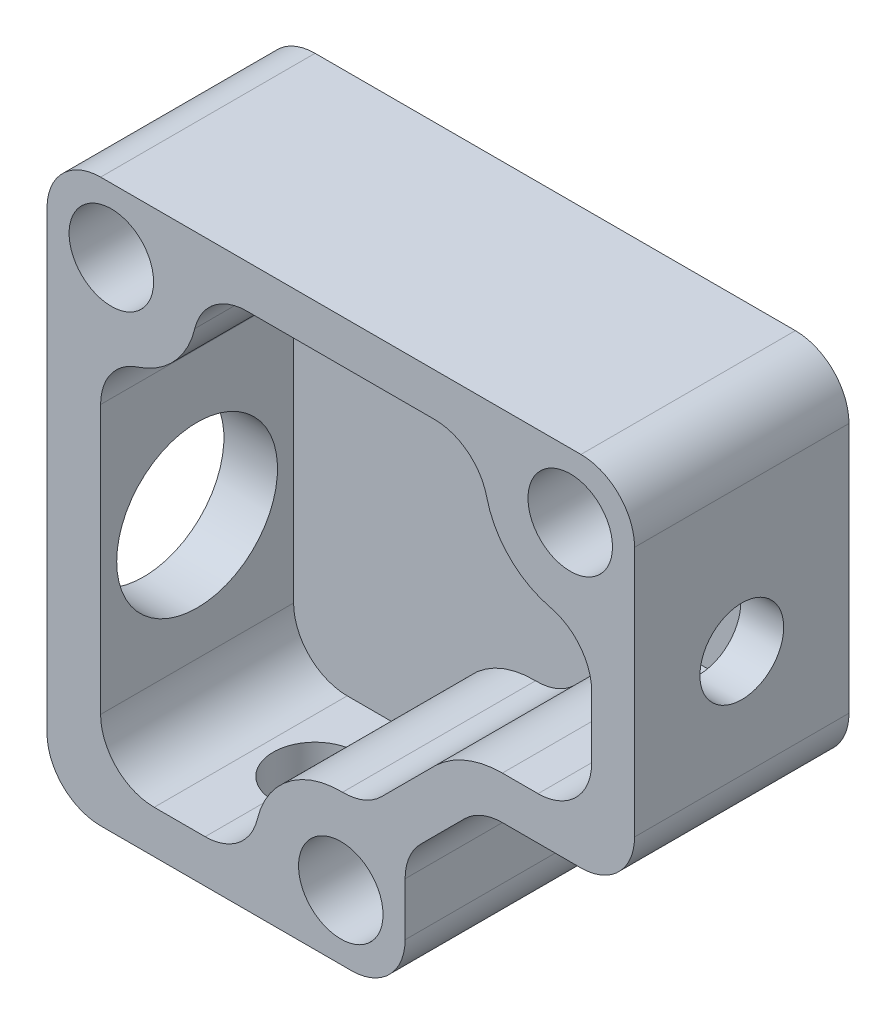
ISO-10303-21;
HEADER;
FILE_DESCRIPTION(('STEP AP214'),'2;1');
FILE_NAME('part.step','',(''),(''),'','','');
FILE_SCHEMA(('AUTOMOTIVE_DESIGN { 1 0 10303 214 1 1 1 1 }'));
ENDSEC;
DATA;
#1=APPLICATION_CONTEXT('core data for automotive mechanical design processes');
#2=APPLICATION_PROTOCOL_DEFINITION('international standard','automotive_design',2000,#1);
#3=PRODUCT_CONTEXT('',#1,'mechanical');
#4=PRODUCT('Part','Part','',(#3));
#5=PRODUCT_RELATED_PRODUCT_CATEGORY('part','',(#4));
#6=PRODUCT_DEFINITION_FORMATION('','',#4);
#7=PRODUCT_DEFINITION_CONTEXT('part definition',#1,'design');
#8=PRODUCT_DEFINITION('design','',#6,#7);
#9=PRODUCT_DEFINITION_SHAPE('','',#8);
#10=(LENGTH_UNIT() NAMED_UNIT(*) SI_UNIT(.MILLI.,.METRE.));
#11=(NAMED_UNIT(*) PLANE_ANGLE_UNIT() SI_UNIT($,.RADIAN.));
#12=(NAMED_UNIT(*) SI_UNIT($,.STERADIAN.) SOLID_ANGLE_UNIT());
#13=UNCERTAINTY_MEASURE_WITH_UNIT(LENGTH_MEASURE(1.E-05),#10,'distance_accuracy_value','');
#14=(GEOMETRIC_REPRESENTATION_CONTEXT(3) GLOBAL_UNCERTAINTY_ASSIGNED_CONTEXT((#13)) GLOBAL_UNIT_ASSIGNED_CONTEXT((#10,
#11,#12)) REPRESENTATION_CONTEXT('',''));
#15=CARTESIAN_POINT('',(0.,0.,0.));
#16=DIRECTION('',(0.,0.,1.));
#17=DIRECTION('',(1.,0.,0.));
#18=AXIS2_PLACEMENT_3D('',#15,#16,#17);
#19=CARTESIAN_POINT('',(0.,0.,25.4));
#20=DIRECTION('',(0.,0.,-1.));
#21=DIRECTION('',(-1.,0.,0.));
#22=AXIS2_PLACEMENT_3D('',#19,#20,#21);
#23=PLANE('',#22);
#24=CARTESIAN_POINT('',(18.7336294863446,11.43,25.4));
#25=DIRECTION('',(0.,0.,1.));
#26=DIRECTION('',(1.,0.,0.));
#27=AXIS2_PLACEMENT_3D('',#24,#25,#26);
#28=CIRCLE('',#27,6.35);
#29=CARTESIAN_POINT('',(18.7336294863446,5.08,25.4));
#30=VERTEX_POINT('',#29);
#31=CARTESIAN_POINT('',(24.9122335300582,9.96461538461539,25.4));
#32=VERTEX_POINT('',#31);
#33=EDGE_CURVE('E352',#30,#32,#28,.T.);
#34=ORIENTED_EDGE('',*,*,#33,.F.);
#35=DIRECTION('',(1.,0.,0.));
#36=VECTOR('',#35,1.);
#37=CARTESIAN_POINT('',(0.,5.08,25.4));
#38=LINE('',#37,#36);
#39=CARTESIAN_POINT('',(12.7,5.08,25.4));
#40=VERTEX_POINT('',#39);
#41=EDGE_CURVE('E60',#40,#30,#38,.T.);
#42=ORIENTED_EDGE('',*,*,#41,.F.);
#43=CARTESIAN_POINT('',(12.7,11.43,25.4));
#44=DIRECTION('',(0.,0.,1.));
#45=DIRECTION('',(1.,0.,0.));
#46=AXIS2_PLACEMENT_3D('',#43,#44,#45);
#47=CIRCLE('',#46,6.35);
#48=CARTESIAN_POINT('',(6.35,11.43,25.4));
#49=VERTEX_POINT('',#48);
#50=EDGE_CURVE('E292',#49,#40,#47,.T.);
#51=ORIENTED_EDGE('',*,*,#50,.F.);
#52=DIRECTION('',(0.,-1.,0.));
#53=VECTOR('',#52,1.);
#54=CARTESIAN_POINT('',(6.35,0.,25.4));
#55=LINE('',#54,#53);
#56=CARTESIAN_POINT('',(6.35,43.2189675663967,25.4));
#57=VERTEX_POINT('',#56);
#58=EDGE_CURVE('E296',#57,#49,#55,.T.);
#59=ORIENTED_EDGE('',*,*,#58,.F.);
#60=CARTESIAN_POINT('',(12.7,43.2189675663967,25.4));
#61=DIRECTION('',(0.,0.,1.));
#62=DIRECTION('',(1.,0.,0.));
#63=AXIS2_PLACEMENT_3D('',#60,#61,#62);
#64=CIRCLE('',#63,6.35);
#65=CARTESIAN_POINT('',(10.7461538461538,49.2609031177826,25.4));
#66=VERTEX_POINT('',#65);
#67=EDGE_CURVE('E407',#66,#57,#64,.T.);
#68=ORIENTED_EDGE('',*,*,#67,.F.);
#69=CARTESIAN_POINT('',(7.62,58.928,25.4));
#70=DIRECTION('',(0.,0.,1.));
#71=DIRECTION('',(1.,0.,0.));
#72=AXIS2_PLACEMENT_3D('',#69,#70,#71);
#73=CIRCLE('',#72,10.16);
#74=CARTESIAN_POINT('',(17.5057664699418,56.5833846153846,25.4));
#75=VERTEX_POINT('',#74);
#76=EDGE_CURVE('E403',#66,#75,#73,.T.);
#77=ORIENTED_EDGE('',*,*,#76,.T.);
#78=CARTESIAN_POINT('',(23.6843705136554,55.118,25.4));
#79=DIRECTION('',(0.,0.,1.));
#80=DIRECTION('',(1.,0.,0.));
#81=AXIS2_PLACEMENT_3D('',#78,#79,#80);
#82=CIRCLE('',#81,6.35);
#83=CARTESIAN_POINT('',(23.6843705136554,61.468,25.4));
#84=VERTEX_POINT('',#83);
#85=EDGE_CURVE('E399',#84,#75,#82,.T.);
#86=ORIENTED_EDGE('',*,*,#85,.F.);
#87=DIRECTION('',(1.,0.,0.));
#88=VECTOR('',#87,1.);
#89=CARTESIAN_POINT('',(0.,61.468,25.4));
#90=LINE('',#89,#88);
#91=CARTESIAN_POINT('',(45.9116294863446,61.468,25.4));
#92=VERTEX_POINT('',#91);
#93=EDGE_CURVE('E395',#84,#92,#90,.T.);
#94=ORIENTED_EDGE('',*,*,#93,.T.);
#95=CARTESIAN_POINT('',(45.9116294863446,55.118,25.4));
#96=DIRECTION('',(0.,0.,1.));
#97=DIRECTION('',(1.,0.,0.));
#98=AXIS2_PLACEMENT_3D('',#95,#96,#97);
#99=CIRCLE('',#98,6.35);
#100=CARTESIAN_POINT('',(52.0902335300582,56.5833846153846,25.4));
#101=VERTEX_POINT('',#100);
#102=EDGE_CURVE('E391',#101,#92,#99,.T.);
#103=ORIENTED_EDGE('',*,*,#102,.F.);
#104=CARTESIAN_POINT('',(61.976,58.928,25.4));
#105=DIRECTION('',(0.,0.,1.));
#106=DIRECTION('',(1.,0.,0.));
#107=AXIS2_PLACEMENT_3D('',#104,#105,#106);
#108=CIRCLE('',#107,10.16);
#109=CARTESIAN_POINT('',(59.6313846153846,49.0422335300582,25.4));
#110=VERTEX_POINT('',#109);
#111=EDGE_CURVE('E387',#101,#110,#108,.T.);
#112=ORIENTED_EDGE('',*,*,#111,.T.);
#113=CARTESIAN_POINT('',(58.166,42.8636294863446,25.4));
#114=DIRECTION('',(0.,0.,1.));
#115=DIRECTION('',(1.,0.,0.));
#116=AXIS2_PLACEMENT_3D('',#113,#114,#115);
#117=CIRCLE('',#116,6.35);
#118=CARTESIAN_POINT('',(64.516,42.8636294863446,25.4));
#119=VERTEX_POINT('',#118);
#120=EDGE_CURVE('E383',#119,#110,#117,.T.);
#121=ORIENTED_EDGE('',*,*,#120,.F.);
#122=DIRECTION('',(0.,-1.,0.));
#123=VECTOR('',#122,1.);
#124=CARTESIAN_POINT('',(64.516,0.,25.4));
#125=LINE('',#124,#123);
#126=CARTESIAN_POINT('',(64.516,35.56,25.4));
#127=VERTEX_POINT('',#126);
#128=EDGE_CURVE('E379',#119,#127,#125,.T.);
#129=ORIENTED_EDGE('',*,*,#128,.T.);
#130=CARTESIAN_POINT('',(58.166,35.56,25.4));
#131=DIRECTION('',(0.,0.,1.));
#132=DIRECTION('',(1.,0.,0.));
#133=AXIS2_PLACEMENT_3D('',#130,#131,#132);
#134=CIRCLE('',#133,6.34999999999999);
#135=CARTESIAN_POINT('',(58.166,29.21,25.4));
#136=VERTEX_POINT('',#135);
#137=EDGE_CURVE('E375',#127,#136,#134,.F.);
#138=ORIENTED_EDGE('',*,*,#137,.T.);
#139=DIRECTION('',(-1.,0.,0.));
#140=VECTOR('',#139,1.);
#141=CARTESIAN_POINT('',(0.,29.21,25.4));
#142=LINE('',#141,#140);
#143=CARTESIAN_POINT('',(53.939256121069,29.21,25.4));
#144=VERTEX_POINT('',#143);
#145=EDGE_CURVE('E371',#136,#144,#142,.T.);
#146=ORIENTED_EDGE('',*,*,#145,.T.);
#147=CARTESIAN_POINT('',(53.939256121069,17.7643186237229,25.4));
#148=DIRECTION('',(0.,0.,1.));
#149=DIRECTION('',(1.,0.,0.));
#150=AXIS2_PLACEMENT_3D('',#147,#148,#149);
#151=CIRCLE('',#150,11.4456813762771);
#152=CARTESIAN_POINT('',(46.0595611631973,26.0657660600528,25.4));
#153=VERTEX_POINT('',#152);
#154=EDGE_CURVE('E367',#144,#153,#151,.T.);
#155=ORIENTED_EDGE('',*,*,#154,.T.);
#156=DIRECTION('',(-0.707106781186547,-0.707106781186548,0.));
#157=VECTOR('',#156,1.);
#158=CARTESIAN_POINT('',(9.9968975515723,-9.99689755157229,25.4));
#159=LINE('',#158,#157);
#160=CARTESIAN_POINT('',(39.6301245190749,19.6363294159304,25.4));
#161=VERTEX_POINT('',#160);
#162=EDGE_CURVE('E363',#153,#161,#159,.T.);
#163=ORIENTED_EDGE('',*,*,#162,.T.);
#164=CARTESIAN_POINT('',(35.1399964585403,24.126457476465,25.4));
#165=DIRECTION('',(0.,0.,1.));
#166=DIRECTION('',(1.,0.,0.));
#167=AXIS2_PLACEMENT_3D('',#164,#165,#166);
#168=CIRCLE('',#167,6.35);
#169=CARTESIAN_POINT('',(35.0084593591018,17.7778199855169,25.4));
#170=VERTEX_POINT('',#169);
#171=EDGE_CURVE('E359',#170,#161,#168,.T.);
#172=ORIENTED_EDGE('',*,*,#171,.F.);
#173=CARTESIAN_POINT('',(34.798,7.62,25.4));
#174=DIRECTION('',(0.,0.,1.));
#175=DIRECTION('',(1.,0.,0.));
#176=AXIS2_PLACEMENT_3D('',#173,#174,#175);
#177=CIRCLE('',#176,10.16);
#178=EDGE_CURVE('E355',#170,#32,#177,.T.);
#179=ORIENTED_EDGE('',*,*,#178,.T.);
#180=EDGE_LOOP('',(#34,#42,#51,#59,#68,#77,#86,#94,#103,#112,#121,#129,#138,#146,#155,#163,#172,#179));
#181=FACE_BOUND('',#180,.T.);
#182=DIRECTION('',(0.,-1.,0.));
#183=VECTOR('',#182,1.);
#184=CARTESIAN_POINT('',(0.,0.,25.4));
#185=LINE('',#184,#183);
#186=CARTESIAN_POINT('',(0.,60.198,25.4));
#187=VERTEX_POINT('',#186);
#188=CARTESIAN_POINT('',(0.,6.35,25.4));
#189=VERTEX_POINT('',#188);
#190=EDGE_CURVE('E530',#187,#189,#185,.T.);
#191=ORIENTED_EDGE('',*,*,#190,.T.);
#192=CARTESIAN_POINT('',(6.35,6.35,25.4));
#193=DIRECTION('',(0.,0.,-1.));
#194=DIRECTION('',(-1.,0.,0.));
#195=AXIS2_PLACEMENT_3D('',#192,#193,#194);
#196=CIRCLE('',#195,6.35);
#197=CARTESIAN_POINT('',(6.35,0.,25.4));
#198=VERTEX_POINT('',#197);
#199=EDGE_CURVE('E635',#189,#198,#196,.F.);
#200=ORIENTED_EDGE('',*,*,#199,.T.);
#201=DIRECTION('',(1.,0.,0.));
#202=VECTOR('',#201,1.);
#203=CARTESIAN_POINT('',(0.,0.,25.4));
#204=LINE('',#203,#202);
#205=CARTESIAN_POINT('',(36.068,0.,25.4));
#206=VERTEX_POINT('',#205);
#207=EDGE_CURVE('E534',#198,#206,#204,.T.);
#208=ORIENTED_EDGE('',*,*,#207,.T.);
#209=CARTESIAN_POINT('',(36.068,6.35,25.4));
#210=DIRECTION('',(0.,0.,-1.));
#211=DIRECTION('',(-1.,0.,0.));
#212=AXIS2_PLACEMENT_3D('',#209,#210,#211);
#213=CIRCLE('',#212,6.35);
#214=CARTESIAN_POINT('',(42.418,6.35,25.4));
#215=VERTEX_POINT('',#214);
#216=EDGE_CURVE('E632',#206,#215,#213,.F.);
#217=ORIENTED_EDGE('',*,*,#216,.T.);
#218=DIRECTION('',(0.,-1.,0.));
#219=VECTOR('',#218,1.);
#220=CARTESIAN_POINT('',(42.418,0.,25.4));
#221=LINE('',#220,#219);
#222=CARTESIAN_POINT('',(42.418,12.6097438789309,25.4));
#223=VERTEX_POINT('',#222);
#224=EDGE_CURVE('E494',#223,#215,#221,.T.);
#225=ORIENTED_EDGE('',*,*,#224,.F.);
#226=CARTESIAN_POINT('',(48.768,12.6097438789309,25.4));
#227=DIRECTION('',(0.,0.,-1.));
#228=DIRECTION('',(-1.,0.,0.));
#229=AXIS2_PLACEMENT_3D('',#226,#227,#228);
#230=CIRCLE('',#229,6.35);
#231=CARTESIAN_POINT('',(44.2778719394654,17.0998719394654,25.4));
#232=VERTEX_POINT('',#231);
#233=EDGE_CURVE('E579',#223,#232,#230,.T.);
#234=ORIENTED_EDGE('',*,*,#233,.T.);
#235=DIRECTION('',(-0.707106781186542,-0.707106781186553,0.));
#236=VECTOR('',#235,1.);
#237=CARTESIAN_POINT('',(51.3079999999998,24.13,25.4));
#238=LINE('',#237,#236);
#239=CARTESIAN_POINT('',(49.4481280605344,22.2701280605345,25.4));
#240=VERTEX_POINT('',#239);
#241=EDGE_CURVE('E490',#240,#232,#238,.T.);
#242=ORIENTED_EDGE('',*,*,#241,.F.);
#243=CARTESIAN_POINT('',(53.938256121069,17.78,25.4));
#244=DIRECTION('',(0.,0.,-1.));
#245=DIRECTION('',(-1.,0.,0.));
#246=AXIS2_PLACEMENT_3D('',#243,#244,#245);
#247=CIRCLE('',#246,6.35);
#248=CARTESIAN_POINT('',(53.938256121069,24.13,25.4));
#249=VERTEX_POINT('',#248);
#250=EDGE_CURVE('E586',#240,#249,#247,.T.);
#251=ORIENTED_EDGE('',*,*,#250,.T.);
#252=DIRECTION('',(-1.,0.,0.));
#253=VECTOR('',#252,1.);
#254=CARTESIAN_POINT('',(69.596,24.13,25.4));
#255=LINE('',#254,#253);
#256=CARTESIAN_POINT('',(63.246,24.13,25.4));
#257=VERTEX_POINT('',#256);
#258=EDGE_CURVE('E487',#257,#249,#255,.T.);
#259=ORIENTED_EDGE('',*,*,#258,.F.);
#260=CARTESIAN_POINT('',(63.246,30.48,25.4));
#261=DIRECTION('',(0.,0.,-1.));
#262=DIRECTION('',(-1.,0.,0.));
#263=AXIS2_PLACEMENT_3D('',#260,#261,#262);
#264=CIRCLE('',#263,6.35);
#265=CARTESIAN_POINT('',(69.596,30.48,25.4));
#266=VERTEX_POINT('',#265);
#267=EDGE_CURVE('E629',#257,#266,#264,.F.);
#268=ORIENTED_EDGE('',*,*,#267,.T.);
#269=DIRECTION('',(0.,1.,0.));
#270=VECTOR('',#269,1.);
#271=CARTESIAN_POINT('',(69.596,0.,25.4));
#272=LINE('',#271,#270);
#273=CARTESIAN_POINT('',(69.596,60.198,25.4));
#274=VERTEX_POINT('',#273);
#275=EDGE_CURVE('E539',#266,#274,#272,.T.);
#276=ORIENTED_EDGE('',*,*,#275,.T.);
#277=CARTESIAN_POINT('',(63.246,60.198,25.4));
#278=DIRECTION('',(0.,0.,-1.));
#279=DIRECTION('',(-1.,0.,0.));
#280=AXIS2_PLACEMENT_3D('',#277,#278,#279);
#281=CIRCLE('',#280,6.35);
#282=CARTESIAN_POINT('',(63.246,66.548,25.4));
#283=VERTEX_POINT('',#282);
#284=EDGE_CURVE('E626',#274,#283,#281,.F.);
#285=ORIENTED_EDGE('',*,*,#284,.T.);
#286=DIRECTION('',(-1.,0.,0.));
#287=VECTOR('',#286,1.);
#288=CARTESIAN_POINT('',(0.,66.548,25.4));
#289=LINE('',#288,#287);
#290=CARTESIAN_POINT('',(6.35,66.548,25.4));
#291=VERTEX_POINT('',#290);
#292=EDGE_CURVE('E543',#283,#291,#289,.T.);
#293=ORIENTED_EDGE('',*,*,#292,.T.);
#294=CARTESIAN_POINT('',(6.35,60.198,25.4));
#295=DIRECTION('',(0.,0.,-1.));
#296=DIRECTION('',(-1.,0.,0.));
#297=AXIS2_PLACEMENT_3D('',#294,#295,#296);
#298=CIRCLE('',#297,6.35);
#299=EDGE_CURVE('E623',#291,#187,#298,.F.);
#300=ORIENTED_EDGE('',*,*,#299,.T.);
#301=EDGE_LOOP('',(#191,#200,#208,#217,#225,#234,#242,#251,#259,#268,#276,#285,#293,#300));
#302=FACE_BOUND('',#301,.T.);
#303=CARTESIAN_POINT('',(7.62,58.928,25.4));
#304=DIRECTION('',(0.,0.,1.));
#305=DIRECTION('',(1.,0.,0.));
#306=AXIS2_PLACEMENT_3D('',#303,#304,#305);
#307=CIRCLE('',#306,5.0038);
#308=CARTESIAN_POINT('',(12.6238,58.928,25.4));
#309=VERTEX_POINT('',#308);
#310=EDGE_CURVE('E522',#309,#309,#307,.T.);
#311=ORIENTED_EDGE('',*,*,#310,.F.);
#312=EDGE_LOOP('',(#311));
#313=FACE_BOUND('',#312,.T.);
#314=CARTESIAN_POINT('',(61.976,58.928,25.4));
#315=DIRECTION('',(0.,0.,1.));
#316=DIRECTION('',(1.,0.,0.));
#317=AXIS2_PLACEMENT_3D('',#314,#315,#316);
#318=CIRCLE('',#317,5.0038);
#319=CARTESIAN_POINT('',(66.9798,58.928,25.4));
#320=VERTEX_POINT('',#319);
#321=EDGE_CURVE('E514',#320,#320,#318,.T.);
#322=ORIENTED_EDGE('',*,*,#321,.F.);
#323=EDGE_LOOP('',(#322));
#324=FACE_BOUND('',#323,.T.);
#325=CARTESIAN_POINT('',(34.798,7.62,25.4));
#326=DIRECTION('',(0.,0.,1.));
#327=DIRECTION('',(1.,0.,0.));
#328=AXIS2_PLACEMENT_3D('',#325,#326,#327);
#329=CIRCLE('',#328,5.0038);
#330=CARTESIAN_POINT('',(39.8018,7.62,25.4));
#331=VERTEX_POINT('',#330);
#332=EDGE_CURVE('E506',#331,#331,#329,.T.);
#333=ORIENTED_EDGE('',*,*,#332,.F.);
#334=EDGE_LOOP('',(#333));
#335=FACE_BOUND('',#334,.T.);
#336=ADVANCED_FACE('F44',(#181,#302,#313,#324,#335),#23,.F.);
#337=CARTESIAN_POINT('',(0.,0.,0.));
#338=DIRECTION('',(0.,0.,-1.));
#339=DIRECTION('',(-1.,0.,0.));
#340=AXIS2_PLACEMENT_3D('',#337,#338,#339);
#341=PLANE('',#340);
#342=DIRECTION('',(1.,0.,0.));
#343=VECTOR('',#342,1.);
#344=CARTESIAN_POINT('',(0.,0.,0.));
#345=LINE('',#344,#343);
#346=CARTESIAN_POINT('',(6.35,0.,0.));
#347=VERTEX_POINT('',#346);
#348=CARTESIAN_POINT('',(36.068,0.,0.));
#349=VERTEX_POINT('',#348);
#350=EDGE_CURVE('E551',#347,#349,#345,.T.);
#351=ORIENTED_EDGE('',*,*,#350,.F.);
#352=CARTESIAN_POINT('',(6.35,6.35,0.));
#353=DIRECTION('',(0.,0.,-1.));
#354=DIRECTION('',(-1.,0.,0.));
#355=AXIS2_PLACEMENT_3D('',#352,#353,#354);
#356=CIRCLE('',#355,6.35);
#357=CARTESIAN_POINT('',(0.,6.35,0.));
#358=VERTEX_POINT('',#357);
#359=EDGE_CURVE('E613',#347,#358,#356,.T.);
#360=ORIENTED_EDGE('',*,*,#359,.T.);
#361=DIRECTION('',(0.,-1.,0.));
#362=VECTOR('',#361,1.);
#363=CARTESIAN_POINT('',(0.,0.,0.));
#364=LINE('',#363,#362);
#365=CARTESIAN_POINT('',(0.,60.198,0.));
#366=VERTEX_POINT('',#365);
#367=EDGE_CURVE('E526',#366,#358,#364,.T.);
#368=ORIENTED_EDGE('',*,*,#367,.F.);
#369=CARTESIAN_POINT('',(6.35,60.198,0.));
#370=DIRECTION('',(0.,0.,-1.));
#371=DIRECTION('',(-1.,0.,0.));
#372=AXIS2_PLACEMENT_3D('',#369,#370,#371);
#373=CIRCLE('',#372,6.35);
#374=CARTESIAN_POINT('',(6.35,66.548,0.));
#375=VERTEX_POINT('',#374);
#376=EDGE_CURVE('E601',#366,#375,#373,.T.);
#377=ORIENTED_EDGE('',*,*,#376,.T.);
#378=DIRECTION('',(-1.,0.,0.));
#379=VECTOR('',#378,1.);
#380=CARTESIAN_POINT('',(0.,66.548,0.));
#381=LINE('',#380,#379);
#382=CARTESIAN_POINT('',(63.246,66.548,0.));
#383=VERTEX_POINT('',#382);
#384=EDGE_CURVE('E535',#383,#375,#381,.T.);
#385=ORIENTED_EDGE('',*,*,#384,.F.);
#386=CARTESIAN_POINT('',(63.246,60.198,0.));
#387=DIRECTION('',(0.,0.,-1.));
#388=DIRECTION('',(-1.,0.,0.));
#389=AXIS2_PLACEMENT_3D('',#386,#387,#388);
#390=CIRCLE('',#389,6.35);
#391=CARTESIAN_POINT('',(69.596,60.198,0.));
#392=VERTEX_POINT('',#391);
#393=EDGE_CURVE('E604',#383,#392,#390,.T.);
#394=ORIENTED_EDGE('',*,*,#393,.T.);
#395=DIRECTION('',(0.,1.,0.));
#396=VECTOR('',#395,1.);
#397=CARTESIAN_POINT('',(69.596,0.,0.));
#398=LINE('',#397,#396);
#399=CARTESIAN_POINT('',(69.596,30.48,0.));
#400=VERTEX_POINT('',#399);
#401=EDGE_CURVE('E555',#400,#392,#398,.T.);
#402=ORIENTED_EDGE('',*,*,#401,.F.);
#403=CARTESIAN_POINT('',(63.246,30.48,0.));
#404=DIRECTION('',(0.,0.,-1.));
#405=DIRECTION('',(-1.,0.,0.));
#406=AXIS2_PLACEMENT_3D('',#403,#404,#405);
#407=CIRCLE('',#406,6.35);
#408=CARTESIAN_POINT('',(63.246,24.13,0.));
#409=VERTEX_POINT('',#408);
#410=EDGE_CURVE('E607',#400,#409,#407,.T.);
#411=ORIENTED_EDGE('',*,*,#410,.T.);
#412=DIRECTION('',(1.,0.,0.));
#413=VECTOR('',#412,1.);
#414=CARTESIAN_POINT('',(0.,24.13,0.));
#415=LINE('',#414,#413);
#416=CARTESIAN_POINT('',(53.938256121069,24.13,0.));
#417=VERTEX_POINT('',#416);
#418=EDGE_CURVE('E498',#417,#409,#415,.T.);
#419=ORIENTED_EDGE('',*,*,#418,.F.);
#420=CARTESIAN_POINT('',(53.938256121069,17.78,0.));
#421=DIRECTION('',(0.,0.,-1.));
#422=DIRECTION('',(-1.,0.,0.));
#423=AXIS2_PLACEMENT_3D('',#420,#421,#422);
#424=CIRCLE('',#423,6.35);
#425=CARTESIAN_POINT('',(49.4481280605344,22.2701280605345,0.));
#426=VERTEX_POINT('',#425);
#427=EDGE_CURVE('E590',#417,#426,#424,.F.);
#428=ORIENTED_EDGE('',*,*,#427,.T.);
#429=DIRECTION('',(0.707106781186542,0.707106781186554,0.));
#430=VECTOR('',#429,1.);
#431=CARTESIAN_POINT('',(13.5890000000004,-13.5890000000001,0.));
#432=LINE('',#431,#430);
#433=CARTESIAN_POINT('',(44.2778719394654,17.0998719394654,0.));
#434=VERTEX_POINT('',#433);
#435=EDGE_CURVE('E547',#434,#426,#432,.T.);
#436=ORIENTED_EDGE('',*,*,#435,.F.);
#437=CARTESIAN_POINT('',(48.768,12.6097438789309,0.));
#438=DIRECTION('',(0.,0.,-1.));
#439=DIRECTION('',(-1.,0.,0.));
#440=AXIS2_PLACEMENT_3D('',#437,#438,#439);
#441=CIRCLE('',#440,6.35);
#442=CARTESIAN_POINT('',(42.418,12.6097438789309,0.));
#443=VERTEX_POINT('',#442);
#444=EDGE_CURVE('E582',#434,#443,#441,.F.);
#445=ORIENTED_EDGE('',*,*,#444,.T.);
#446=DIRECTION('',(0.,1.,0.));
#447=VECTOR('',#446,1.);
#448=CARTESIAN_POINT('',(42.418,0.,0.));
#449=LINE('',#448,#447);
#450=CARTESIAN_POINT('',(42.418,6.35,0.));
#451=VERTEX_POINT('',#450);
#452=EDGE_CURVE('E502',#451,#443,#449,.T.);
#453=ORIENTED_EDGE('',*,*,#452,.F.);
#454=CARTESIAN_POINT('',(36.068,6.35,0.));
#455=DIRECTION('',(0.,0.,-1.));
#456=DIRECTION('',(-1.,0.,0.));
#457=AXIS2_PLACEMENT_3D('',#454,#455,#456);
#458=CIRCLE('',#457,6.35);
#459=EDGE_CURVE('E610',#451,#349,#458,.T.);
#460=ORIENTED_EDGE('',*,*,#459,.T.);
#461=EDGE_LOOP('',(#351,#360,#368,#377,#385,#394,#402,#411,#419,#428,#436,#445,#453,#460));
#462=FACE_BOUND('',#461,.T.);
#463=CARTESIAN_POINT('',(61.976,58.928,0.));
#464=DIRECTION('',(0.,0.,1.));
#465=DIRECTION('',(1.,0.,0.));
#466=AXIS2_PLACEMENT_3D('',#463,#464,#465);
#467=CIRCLE('',#466,5.0038);
#468=CARTESIAN_POINT('',(66.9798,58.928,0.));
#469=VERTEX_POINT('',#468);
#470=EDGE_CURVE('E510',#469,#469,#467,.T.);
#471=ORIENTED_EDGE('',*,*,#470,.T.);
#472=EDGE_LOOP('',(#471));
#473=FACE_BOUND('',#472,.T.);
#474=CARTESIAN_POINT('',(7.62,58.928,0.));
#475=DIRECTION('',(0.,0.,1.));
#476=DIRECTION('',(1.,0.,0.));
#477=AXIS2_PLACEMENT_3D('',#474,#475,#476);
#478=CIRCLE('',#477,5.0038);
#479=CARTESIAN_POINT('',(12.6238,58.928,0.));
#480=VERTEX_POINT('',#479);
#481=EDGE_CURVE('E518',#480,#480,#478,.T.);
#482=ORIENTED_EDGE('',*,*,#481,.T.);
#483=EDGE_LOOP('',(#482));
#484=FACE_BOUND('',#483,.T.);
#485=CARTESIAN_POINT('',(34.798,7.62,0.));
#486=DIRECTION('',(0.,0.,1.));
#487=DIRECTION('',(1.,0.,0.));
#488=AXIS2_PLACEMENT_3D('',#485,#486,#487);
#489=CIRCLE('',#488,5.0038);
#490=CARTESIAN_POINT('',(39.8018,7.62,0.));
#491=VERTEX_POINT('',#490);
#492=EDGE_CURVE('E505',#491,#491,#489,.T.);
#493=ORIENTED_EDGE('',*,*,#492,.T.);
#494=EDGE_LOOP('',(#493));
#495=FACE_BOUND('',#494,.T.);
#496=ADVANCED_FACE('F740',(#462,#473,#484,#495),#341,.T.);
#497=CARTESIAN_POINT('',(0.,0.,25.4));
#498=DIRECTION('',(1.,0.,0.));
#499=DIRECTION('',(0.,0.,-1.));
#500=AXIS2_PLACEMENT_3D('',#497,#498,#499);
#501=PLANE('',#500);
#502=CARTESIAN_POINT('',(0.,26.162,13.97));
#503=DIRECTION('',(-1.,0.,0.));
#504=DIRECTION('',(0.,0.,1.));
#505=AXIS2_PLACEMENT_3D('',#502,#503,#504);
#506=CIRCLE('',#505,9.52499999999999);
#507=CARTESIAN_POINT('',(0.,26.162,23.495));
#508=VERTEX_POINT('',#507);
#509=EDGE_CURVE('E467',#508,#508,#506,.T.);
#510=ORIENTED_EDGE('',*,*,#509,.F.);
#511=EDGE_LOOP('',(#510));
#512=FACE_BOUND('',#511,.T.);
#513=CARTESIAN_POINT('',(0.,50.3920557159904,21.59));
#514=DIRECTION('',(-1.,0.,0.));
#515=DIRECTION('',(0.,0.,1.));
#516=AXIS2_PLACEMENT_3D('',#513,#514,#515);
#517=CIRCLE('',#516,2.5);
#518=CARTESIAN_POINT('',(0.,50.3920557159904,24.09));
#519=VERTEX_POINT('',#518);
#520=EDGE_CURVE('E471',#519,#519,#517,.T.);
#521=ORIENTED_EDGE('',*,*,#520,.F.);
#522=EDGE_LOOP('',(#521));
#523=FACE_BOUND('',#522,.T.);
#524=ORIENTED_EDGE('',*,*,#367,.T.);
#525=DIRECTION('',(0.,0.,-1.));
#526=VECTOR('',#525,1.);
#527=CARTESIAN_POINT('',(0.,6.35,25.4));
#528=LINE('',#527,#526);
#529=EDGE_CURVE('E620',#358,#189,#528,.F.);
#530=ORIENTED_EDGE('',*,*,#529,.T.);
#531=ORIENTED_EDGE('',*,*,#190,.F.);
#532=DIRECTION('',(0.,0.,-1.));
#533=VECTOR('',#532,1.);
#534=CARTESIAN_POINT('',(0.,60.198,25.4));
#535=LINE('',#534,#533);
#536=EDGE_CURVE('E616',#187,#366,#535,.T.);
#537=ORIENTED_EDGE('',*,*,#536,.T.);
#538=EDGE_LOOP('',(#524,#530,#531,#537));
#539=FACE_BOUND('',#538,.T.);
#540=ADVANCED_FACE('F746',(#512,#523,#539),#501,.F.);
#541=CARTESIAN_POINT('',(0.,0.,25.4));
#542=DIRECTION('',(0.,1.,0.));
#543=DIRECTION('',(0.,0.,1.));
#544=AXIS2_PLACEMENT_3D('',#541,#542,#543);
#545=PLANE('',#544);
#546=CARTESIAN_POINT('',(19.05,0.,12.7));
#547=DIRECTION('',(0.,-1.,0.));
#548=DIRECTION('',(0.,0.,-1.));
#549=AXIS2_PLACEMENT_3D('',#546,#547,#548);
#550=CIRCLE('',#549,4.961001);
#551=CARTESIAN_POINT('',(19.05,0.,7.738999));
#552=VERTEX_POINT('',#551);
#553=EDGE_CURVE('E483',#552,#552,#550,.T.);
#554=ORIENTED_EDGE('',*,*,#553,.F.);
#555=EDGE_LOOP('',(#554));
#556=FACE_BOUND('',#555,.T.);
#557=ORIENTED_EDGE('',*,*,#207,.F.);
#558=DIRECTION('',(0.,0.,-1.));
#559=VECTOR('',#558,1.);
#560=CARTESIAN_POINT('',(6.35,0.,25.4));
#561=LINE('',#560,#559);
#562=EDGE_CURVE('E597',#198,#347,#561,.T.);
#563=ORIENTED_EDGE('',*,*,#562,.T.);
#564=ORIENTED_EDGE('',*,*,#350,.T.);
#565=DIRECTION('',(0.,0.,1.));
#566=VECTOR('',#565,1.);
#567=CARTESIAN_POINT('',(36.068,0.,25.4));
#568=LINE('',#567,#566);
#569=EDGE_CURVE('E593',#349,#206,#568,.T.);
#570=ORIENTED_EDGE('',*,*,#569,.T.);
#571=EDGE_LOOP('',(#557,#563,#564,#570));
#572=FACE_BOUND('',#571,.T.);
#573=ADVANCED_FACE('F762',(#556,#572),#545,.F.);
#574=CARTESIAN_POINT('',(69.596,0.,25.4));
#575=DIRECTION('',(-1.,0.,0.));
#576=DIRECTION('',(0.,0.,1.));
#577=AXIS2_PLACEMENT_3D('',#574,#575,#576);
#578=PLANE('',#577);
#579=CARTESIAN_POINT('',(69.596,43.18,12.7));
#580=DIRECTION('',(1.,0.,0.));
#581=DIRECTION('',(0.,0.,-1.));
#582=AXIS2_PLACEMENT_3D('',#579,#580,#581);
#583=CIRCLE('',#582,4.961001);
#584=CARTESIAN_POINT('',(69.596,43.18,7.738999));
#585=VERTEX_POINT('',#584);
#586=EDGE_CURVE('E479',#585,#585,#583,.T.);
#587=ORIENTED_EDGE('',*,*,#586,.F.);
#588=EDGE_LOOP('',(#587));
#589=FACE_BOUND('',#588,.T.);
#590=ORIENTED_EDGE('',*,*,#275,.F.);
#591=DIRECTION('',(0.,0.,-1.));
#592=VECTOR('',#591,1.);
#593=CARTESIAN_POINT('',(69.596,30.48,25.4));
#594=LINE('',#593,#592);
#595=EDGE_CURVE('E644',#266,#400,#594,.T.);
#596=ORIENTED_EDGE('',*,*,#595,.T.);
#597=ORIENTED_EDGE('',*,*,#401,.T.);
#598=DIRECTION('',(0.,0.,-1.));
#599=VECTOR('',#598,1.);
#600=CARTESIAN_POINT('',(69.596,60.198,25.4));
#601=LINE('',#600,#599);
#602=EDGE_CURVE('E641',#392,#274,#601,.F.);
#603=ORIENTED_EDGE('',*,*,#602,.T.);
#604=EDGE_LOOP('',(#590,#596,#597,#603));
#605=FACE_BOUND('',#604,.T.);
#606=ADVANCED_FACE('F758',(#589,#605),#578,.F.);
#607=CARTESIAN_POINT('',(0.,66.548,25.4));
#608=DIRECTION('',(0.,-1.,0.));
#609=DIRECTION('',(0.,0.,-1.));
#610=AXIS2_PLACEMENT_3D('',#607,#608,#609);
#611=PLANE('',#610);
#612=ORIENTED_EDGE('',*,*,#292,.F.);
#613=DIRECTION('',(0.,0.,-1.));
#614=VECTOR('',#613,1.);
#615=CARTESIAN_POINT('',(63.246,66.548,25.4));
#616=LINE('',#615,#614);
#617=EDGE_CURVE('E654',#283,#383,#616,.T.);
#618=ORIENTED_EDGE('',*,*,#617,.T.);
#619=ORIENTED_EDGE('',*,*,#384,.T.);
#620=DIRECTION('',(0.,0.,-1.));
#621=VECTOR('',#620,1.);
#622=CARTESIAN_POINT('',(6.35,66.548,25.4));
#623=LINE('',#622,#621);
#624=EDGE_CURVE('E651',#375,#291,#623,.F.);
#625=ORIENTED_EDGE('',*,*,#624,.T.);
#626=EDGE_LOOP('',(#612,#618,#619,#625));
#627=FACE_BOUND('',#626,.T.);
#628=ADVANCED_FACE('F755',(#627),#611,.F.);
#629=CARTESIAN_POINT('',(7.62,58.928,25.4));
#630=DIRECTION('',(0.,0.,-1.));
#631=DIRECTION('',(-1.,0.,0.));
#632=AXIS2_PLACEMENT_3D('',#629,#630,#631);
#633=CYLINDRICAL_SURFACE('',#632,5.0038);
#634=ORIENTED_EDGE('',*,*,#310,.T.);
#635=EDGE_LOOP('',(#634));
#636=FACE_BOUND('',#635,.T.);
#637=ORIENTED_EDGE('',*,*,#481,.F.);
#638=EDGE_LOOP('',(#637));
#639=FACE_BOUND('',#638,.T.);
#640=ADVANCED_FACE('F752',(#636,#639),#633,.F.);
#641=CARTESIAN_POINT('',(61.976,58.928,25.4));
#642=DIRECTION('',(0.,0.,-1.));
#643=DIRECTION('',(-1.,0.,0.));
#644=AXIS2_PLACEMENT_3D('',#641,#642,#643);
#645=CYLINDRICAL_SURFACE('',#644,5.0038);
#646=ORIENTED_EDGE('',*,*,#321,.T.);
#647=EDGE_LOOP('',(#646));
#648=FACE_BOUND('',#647,.T.);
#649=ORIENTED_EDGE('',*,*,#470,.F.);
#650=EDGE_LOOP('',(#649));
#651=FACE_BOUND('',#650,.T.);
#652=ADVANCED_FACE('F852',(#648,#651),#645,.F.);
#653=CARTESIAN_POINT('',(34.798,7.62,25.4));
#654=DIRECTION('',(0.,0.,-1.));
#655=DIRECTION('',(-1.,0.,0.));
#656=AXIS2_PLACEMENT_3D('',#653,#654,#655);
#657=CYLINDRICAL_SURFACE('',#656,5.0038);
#658=ORIENTED_EDGE('',*,*,#332,.T.);
#659=EDGE_LOOP('',(#658));
#660=FACE_BOUND('',#659,.T.);
#661=ORIENTED_EDGE('',*,*,#492,.F.);
#662=EDGE_LOOP('',(#661));
#663=FACE_BOUND('',#662,.T.);
#664=ADVANCED_FACE('F850',(#660,#663),#657,.F.);
#665=CARTESIAN_POINT('',(42.418,0.,-19.05));
#666=DIRECTION('',(-1.,0.,0.));
#667=DIRECTION('',(0.,0.,1.));
#668=AXIS2_PLACEMENT_3D('',#665,#666,#667);
#669=PLANE('',#668);
#670=ORIENTED_EDGE('',*,*,#224,.T.);
#671=DIRECTION('',(0.,0.,1.));
#672=VECTOR('',#671,1.);
#673=CARTESIAN_POINT('',(42.418,6.35,-19.05));
#674=LINE('',#673,#672);
#675=EDGE_CURVE('E638',#215,#451,#674,.F.);
#676=ORIENTED_EDGE('',*,*,#675,.T.);
#677=ORIENTED_EDGE('',*,*,#452,.T.);
#678=DIRECTION('',(0.,0.,1.));
#679=VECTOR('',#678,1.);
#680=CARTESIAN_POINT('',(42.418,12.6097438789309,25.4));
#681=LINE('',#680,#679);
#682=EDGE_CURVE('E565',#443,#223,#681,.T.);
#683=ORIENTED_EDGE('',*,*,#682,.T.);
#684=EDGE_LOOP('',(#670,#676,#677,#683));
#685=FACE_BOUND('',#684,.T.);
#686=ADVANCED_FACE('F821',(#685),#669,.F.);
#687=CARTESIAN_POINT('',(51.3079999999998,24.13,-19.05));
#688=DIRECTION('',(-0.707106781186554,0.707106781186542,0.));
#689=DIRECTION('',(-0.707106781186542,-0.707106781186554,0.));
#690=AXIS2_PLACEMENT_3D('',#687,#688,#689);
#691=PLANE('',#690);
#692=ORIENTED_EDGE('',*,*,#241,.T.);
#693=DIRECTION('',(0.,0.,1.));
#694=VECTOR('',#693,1.);
#695=CARTESIAN_POINT('',(44.2778719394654,17.0998719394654,0.));
#696=LINE('',#695,#694);
#697=EDGE_CURVE('E573',#232,#434,#696,.F.);
#698=ORIENTED_EDGE('',*,*,#697,.T.);
#699=ORIENTED_EDGE('',*,*,#435,.T.);
#700=DIRECTION('',(0.,0.,1.));
#701=VECTOR('',#700,1.);
#702=CARTESIAN_POINT('',(49.4481280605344,22.2701280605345,25.4));
#703=LINE('',#702,#701);
#704=EDGE_CURVE('E569',#426,#240,#703,.T.);
#705=ORIENTED_EDGE('',*,*,#704,.T.);
#706=EDGE_LOOP('',(#692,#698,#699,#705));
#707=FACE_BOUND('',#706,.T.);
#708=ADVANCED_FACE('F828',(#707),#691,.F.);
#709=CARTESIAN_POINT('',(69.596,24.13,-19.05));
#710=DIRECTION('',(0.,1.,0.));
#711=DIRECTION('',(-1.,0.,0.));
#712=AXIS2_PLACEMENT_3D('',#709,#710,#711);
#713=PLANE('',#712);
#714=ORIENTED_EDGE('',*,*,#418,.T.);
#715=DIRECTION('',(0.,0.,-1.));
#716=VECTOR('',#715,1.);
#717=CARTESIAN_POINT('',(63.246,24.13,-19.05));
#718=LINE('',#717,#716);
#719=EDGE_CURVE('E648',#409,#257,#718,.F.);
#720=ORIENTED_EDGE('',*,*,#719,.T.);
#721=ORIENTED_EDGE('',*,*,#258,.T.);
#722=DIRECTION('',(0.,0.,1.));
#723=VECTOR('',#722,1.);
#724=CARTESIAN_POINT('',(53.938256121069,24.13,0.));
#725=LINE('',#724,#723);
#726=EDGE_CURVE('E576',#249,#417,#725,.F.);
#727=ORIENTED_EDGE('',*,*,#726,.T.);
#728=EDGE_LOOP('',(#714,#720,#721,#727));
#729=FACE_BOUND('',#728,.T.);
#730=ADVANCED_FACE('F774',(#729),#713,.F.);
#731=CARTESIAN_POINT('',(48.768,12.6097438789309,-19.05));
#732=DIRECTION('',(0.,0.,-1.));
#733=DIRECTION('',(-1.,0.,0.));
#734=AXIS2_PLACEMENT_3D('',#731,#732,#733);
#735=CYLINDRICAL_SURFACE('',#734,6.35);
#736=ORIENTED_EDGE('',*,*,#444,.F.);
#737=ORIENTED_EDGE('',*,*,#697,.F.);
#738=ORIENTED_EDGE('',*,*,#233,.F.);
#739=ORIENTED_EDGE('',*,*,#682,.F.);
#740=EDGE_LOOP('',(#736,#737,#738,#739));
#741=FACE_BOUND('',#740,.T.);
#742=ADVANCED_FACE('F770',(#741),#735,.F.);
#743=CARTESIAN_POINT('',(53.938256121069,17.78,-19.05));
#744=DIRECTION('',(0.,0.,-1.));
#745=DIRECTION('',(-1.,0.,0.));
#746=AXIS2_PLACEMENT_3D('',#743,#744,#745);
#747=CYLINDRICAL_SURFACE('',#746,6.35);
#748=ORIENTED_EDGE('',*,*,#427,.F.);
#749=ORIENTED_EDGE('',*,*,#726,.F.);
#750=ORIENTED_EDGE('',*,*,#250,.F.);
#751=ORIENTED_EDGE('',*,*,#704,.F.);
#752=EDGE_LOOP('',(#748,#749,#750,#751));
#753=FACE_BOUND('',#752,.T.);
#754=ADVANCED_FACE('F773',(#753),#747,.F.);
#755=CARTESIAN_POINT('',(6.35,6.35,25.4));
#756=DIRECTION('',(0.,0.,-1.));
#757=DIRECTION('',(-1.,0.,0.));
#758=AXIS2_PLACEMENT_3D('',#755,#756,#757);
#759=CYLINDRICAL_SURFACE('',#758,6.35);
#760=ORIENTED_EDGE('',*,*,#199,.F.);
#761=ORIENTED_EDGE('',*,*,#529,.F.);
#762=ORIENTED_EDGE('',*,*,#359,.F.);
#763=ORIENTED_EDGE('',*,*,#562,.F.);
#764=EDGE_LOOP('',(#760,#761,#762,#763));
#765=FACE_BOUND('',#764,.T.);
#766=ADVANCED_FACE('F778',(#765),#759,.T.);
#767=CARTESIAN_POINT('',(36.068,6.35,25.4));
#768=DIRECTION('',(0.,0.,1.));
#769=DIRECTION('',(1.,0.,0.));
#770=AXIS2_PLACEMENT_3D('',#767,#768,#769);
#771=CYLINDRICAL_SURFACE('',#770,6.35);
#772=ORIENTED_EDGE('',*,*,#459,.F.);
#773=ORIENTED_EDGE('',*,*,#675,.F.);
#774=ORIENTED_EDGE('',*,*,#216,.F.);
#775=ORIENTED_EDGE('',*,*,#569,.F.);
#776=EDGE_LOOP('',(#772,#773,#774,#775));
#777=FACE_BOUND('',#776,.T.);
#778=ADVANCED_FACE('F782',(#777),#771,.T.);
#779=CARTESIAN_POINT('',(63.246,30.48,25.4));
#780=DIRECTION('',(0.,0.,-1.));
#781=DIRECTION('',(-1.,0.,0.));
#782=AXIS2_PLACEMENT_3D('',#779,#780,#781);
#783=CYLINDRICAL_SURFACE('',#782,6.35);
#784=ORIENTED_EDGE('',*,*,#267,.F.);
#785=ORIENTED_EDGE('',*,*,#719,.F.);
#786=ORIENTED_EDGE('',*,*,#410,.F.);
#787=ORIENTED_EDGE('',*,*,#595,.F.);
#788=EDGE_LOOP('',(#784,#785,#786,#787));
#789=FACE_BOUND('',#788,.T.);
#790=ADVANCED_FACE('F786',(#789),#783,.T.);
#791=CARTESIAN_POINT('',(63.246,60.198,25.4));
#792=DIRECTION('',(0.,0.,-1.));
#793=DIRECTION('',(-1.,0.,0.));
#794=AXIS2_PLACEMENT_3D('',#791,#792,#793);
#795=CYLINDRICAL_SURFACE('',#794,6.35);
#796=ORIENTED_EDGE('',*,*,#284,.F.);
#797=ORIENTED_EDGE('',*,*,#602,.F.);
#798=ORIENTED_EDGE('',*,*,#393,.F.);
#799=ORIENTED_EDGE('',*,*,#617,.F.);
#800=EDGE_LOOP('',(#796,#797,#798,#799));
#801=FACE_BOUND('',#800,.T.);
#802=ADVANCED_FACE('F789',(#801),#795,.T.);
#803=CARTESIAN_POINT('',(6.35,60.198,25.4));
#804=DIRECTION('',(0.,0.,-1.));
#805=DIRECTION('',(-1.,0.,0.));
#806=AXIS2_PLACEMENT_3D('',#803,#804,#805);
#807=CYLINDRICAL_SURFACE('',#806,6.35);
#808=ORIENTED_EDGE('',*,*,#299,.F.);
#809=ORIENTED_EDGE('',*,*,#624,.F.);
#810=ORIENTED_EDGE('',*,*,#376,.F.);
#811=ORIENTED_EDGE('',*,*,#536,.F.);
#812=EDGE_LOOP('',(#808,#809,#810,#811));
#813=FACE_BOUND('',#812,.T.);
#814=ADVANCED_FACE('F46',(#813),#807,.T.);
#815=CARTESIAN_POINT('',(19.05,0.,12.7));
#816=DIRECTION('',(0.,-1.,0.));
#817=DIRECTION('',(0.,0.,-1.));
#818=AXIS2_PLACEMENT_3D('',#815,#816,#817);
#819=CYLINDRICAL_SURFACE('',#818,4.961001);
#820=CARTESIAN_POINT('',(18.7336294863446,5.08,17.650903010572));
#821=CARTESIAN_POINT('',(18.8524337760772,5.07997176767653,17.658521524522));
#822=CARTESIAN_POINT('',(18.9715035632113,5.08333299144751,17.6618108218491));
#823=CARTESIAN_POINT('',(19.2091337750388,5.09671860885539,17.6598635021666));
#824=CARTESIAN_POINT('',(19.3276944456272,5.10673930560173,17.6546316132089));
#825=CARTESIAN_POINT('',(19.5625614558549,5.13323375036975,17.6358496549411));
#826=CARTESIAN_POINT('',(19.6788778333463,5.14966107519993,17.6223590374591));
#827=CARTESIAN_POINT('',(19.9092575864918,5.18868236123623,17.5874104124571));
#828=CARTESIAN_POINT('',(20.0233207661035,5.21127685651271,17.565951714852));
#829=CARTESIAN_POINT('',(20.2481917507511,5.26219166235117,17.5155077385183));
#830=CARTESIAN_POINT('',(20.3590060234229,5.29049956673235,17.4865387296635));
#831=CARTESIAN_POINT('',(20.5770270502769,5.35239741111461,17.4215126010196));
#832=CARTESIAN_POINT('',(20.6842324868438,5.3859892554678,17.3854529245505));
#833=CARTESIAN_POINT('',(20.9999571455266,5.49403668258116,17.2672378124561));
#834=CARTESIAN_POINT('',(21.2024045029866,5.57572219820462,17.1750877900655));
#835=CARTESIAN_POINT('',(21.5244427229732,5.72436783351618,17.0023559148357));
#836=CARTESIAN_POINT('',(21.6493670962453,5.78732068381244,16.9279553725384));
#837=CARTESIAN_POINT('',(21.890346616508,5.91851895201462,16.7699743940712));
#838=CARTESIAN_POINT('',(22.0064017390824,5.98676438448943,16.6863939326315));
#839=CARTESIAN_POINT('',(22.2296282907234,6.12736485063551,16.5107375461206));
#840=CARTESIAN_POINT('',(22.3367819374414,6.19972764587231,16.4186453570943));
#841=CARTESIAN_POINT('',(22.5418970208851,6.34713249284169,16.2267418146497));
#842=CARTESIAN_POINT('',(22.6398593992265,6.42217426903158,16.126931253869));
#843=CARTESIAN_POINT('',(22.8281600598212,6.57487304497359,15.9182488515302));
#844=CARTESIAN_POINT('',(22.9183416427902,6.65255280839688,15.8092524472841));
#845=CARTESIAN_POINT('',(23.0891624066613,6.80775496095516,15.5838688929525));
#846=CARTESIAN_POINT('',(23.1697994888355,6.88527731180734,15.4674801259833));
#847=CARTESIAN_POINT('',(23.3212597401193,7.03822287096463,15.2274465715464));
#848=CARTESIAN_POINT('',(23.3920963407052,7.11364883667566,15.1038120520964));
#849=CARTESIAN_POINT('',(23.5237107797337,7.26018960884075,14.8489528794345));
#850=CARTESIAN_POINT('',(23.5844940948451,7.33130674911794,14.7177324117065));
#851=CARTESIAN_POINT('',(23.7069610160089,7.48037143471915,14.419138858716));
#852=CARTESIAN_POINT('',(23.7662153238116,7.55667517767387,14.2499132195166));
#853=CARTESIAN_POINT('',(23.8672044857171,7.69154620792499,13.8996378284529));
#854=CARTESIAN_POINT('',(23.9089758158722,7.7501503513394,13.7186136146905));
#855=CARTESIAN_POINT('',(23.9670962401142,7.83340310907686,13.3771241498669));
#856=CARTESIAN_POINT('',(23.9865025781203,7.86205863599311,13.2181943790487));
#857=CARTESIAN_POINT('',(24.0097035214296,7.89644347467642,12.8968082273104));
#858=CARTESIAN_POINT('',(24.0135183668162,7.90220250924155,12.7343566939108));
#859=CARTESIAN_POINT('',(24.0052116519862,7.88980917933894,12.4108522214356));
#860=CARTESIAN_POINT('',(23.9930923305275,7.87166017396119,12.2497990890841));
#861=CARTESIAN_POINT('',(23.9539956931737,7.81455540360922,11.9332450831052));
#862=CARTESIAN_POINT('',(23.9269927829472,7.77556380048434,11.7777542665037));
#863=CARTESIAN_POINT('',(23.8425386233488,7.65786557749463,11.3967840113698));
#864=CARTESIAN_POINT('',(23.7765727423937,7.56904664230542,11.1763523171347));
#865=CARTESIAN_POINT('',(23.6585721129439,7.42107096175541,10.8600678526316));
#866=CARTESIAN_POINT('',(23.6159498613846,7.36915899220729,10.7568251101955));
#867=CARTESIAN_POINT('',(23.5246470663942,7.26183542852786,10.5549318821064));
#868=CARTESIAN_POINT('',(23.475968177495,7.20642479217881,10.45628015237));
#869=CARTESIAN_POINT('',(23.349528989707,7.06785662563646,10.2199213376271));
#870=CARTESIAN_POINT('',(23.2685535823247,6.9834547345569,10.0846636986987));
#871=CARTESIAN_POINT('',(23.0947387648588,6.81284898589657,9.82314882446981));
#872=CARTESIAN_POINT('',(23.0018941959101,6.72664435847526,9.69689554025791));
#873=CARTESIAN_POINT('',(22.8045581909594,6.55484567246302,9.45356724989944));
#874=CARTESIAN_POINT('',(22.7000757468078,6.46925119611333,9.3364852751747));
#875=CARTESIAN_POINT('',(22.4795455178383,6.30068102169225,9.11188999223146));
#876=CARTESIAN_POINT('',(22.3635019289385,6.21770438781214,9.00437323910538));
#877=CARTESIAN_POINT('',(22.0460485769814,6.00734113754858,8.73763316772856));
#878=CARTESIAN_POINT('',(21.8353790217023,5.88336828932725,8.58635557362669));
#879=CARTESIAN_POINT('',(21.4981885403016,5.71198757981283,8.38315761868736));
#880=CARTESIAN_POINT('',(21.3822936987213,5.65730280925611,8.31939159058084));
#881=CARTESIAN_POINT('',(21.1436732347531,5.55368548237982,8.20046537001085));
#882=CARTESIAN_POINT('',(21.0209490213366,5.50475174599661,8.14530341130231));
#883=CARTESIAN_POINT('',(20.7910156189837,5.42151192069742,8.0531756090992));
#884=CARTESIAN_POINT('',(20.6847890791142,5.38613925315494,8.01471257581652));
#885=CARTESIAN_POINT('',(20.4685220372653,5.32054763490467,7.9447675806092));
#886=CARTESIAN_POINT('',(20.3584823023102,5.29032765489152,7.91328422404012));
#887=CARTESIAN_POINT('',(20.1353004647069,5.23556703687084,7.85780473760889));
#888=CARTESIAN_POINT('',(20.0221626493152,5.21101895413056,7.83379877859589));
#889=CARTESIAN_POINT('',(19.7934108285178,5.16797872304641,7.79364109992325));
#890=CARTESIAN_POINT('',(19.6777976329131,5.14948462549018,7.77748685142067));
#891=CARTESIAN_POINT('',(19.4247316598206,5.11621929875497,7.75126905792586));
#892=CARTESIAN_POINT('',(19.2869530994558,5.10264132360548,7.74273770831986));
#893=CARTESIAN_POINT('',(19.079688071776,5.0890570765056,7.73860481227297));
#894=CARTESIAN_POINT('',(19.0104679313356,5.08565944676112,7.73867324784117));
#895=CARTESIAN_POINT('',(18.8720155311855,5.08113021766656,7.74170930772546));
#896=CARTESIAN_POINT('',(18.8027832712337,5.07999867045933,7.74467699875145));
#897=CARTESIAN_POINT('',(18.7336294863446,5.08,7.74909698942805));
#898=B_SPLINE_CURVE_WITH_KNOTS('',3,(#820,#821,#822,#823,#824,#825,#826,#827,#828,#829,#830,
#831,#832,#833,#834,#835,#836,#837,#838,#839,#840,#841,#842,#843,#844,#845,#846,#847,#848,#849,
#850,#851,#852,#853,#854,#855,#856,#857,#858,#859,#860,#861,#862,#863,#864,#865,#866,#867,#868,
#869,#870,#871,#872,#873,#874,#875,#876,#877,#878,#879,#880,#881,#882,#883,#884,#885,#886,#887,
#888,#889,#890,#891,#892,#893,#894,#895,#896,#897),.UNSPECIFIED.,.F.,.F.,(4,2,2,2,2,2,2,2,2,2,2,
2,2,2,2,2,2,2,2,2,2,2,2,2,2,2,2,2,2,2,2,2,2,2,2,2,2,2,4),(0.,0.357001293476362,
0.713804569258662,1.06806905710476,1.422364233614,1.77589820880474,2.12955989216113,
2.83744594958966,3.31225251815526,3.78706039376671,4.2627950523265,4.73848092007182,
5.22220035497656,5.70602595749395,6.18918176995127,6.67207350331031,7.25514555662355,
7.83699496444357,8.32284924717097,8.80807261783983,9.29322782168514,9.77921992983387,
10.5146970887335,10.8840430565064,11.253288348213,11.789045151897,12.3250356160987,
12.8606147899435,13.3960002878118,14.2544341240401,14.6834271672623,15.1123320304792,
15.4671361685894,15.8218693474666,16.1761342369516,16.530284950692,16.9455527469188,
17.1533796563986,17.3612113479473),.UNSPECIFIED.);
#899=CARTESIAN_POINT('',(18.7336294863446,5.08,17.650903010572));
#900=VERTEX_POINT('',#899);
#901=CARTESIAN_POINT('',(18.7336294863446,5.08,7.74909698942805));
#902=VERTEX_POINT('',#901);
#903=EDGE_CURVE('E53',#900,#902,#898,.T.);
#904=ORIENTED_EDGE('',*,*,#903,.T.);
#905=CARTESIAN_POINT('',(19.05,5.08,12.7));
#906=DIRECTION('',(0.,-1.,0.));
#907=DIRECTION('',(1.,0.,0.));
#908=AXIS2_PLACEMENT_3D('',#905,#906,#907);
#909=CIRCLE('',#908,4.961001);
#910=EDGE_CURVE('E11',#902,#900,#909,.F.);
#911=ORIENTED_EDGE('',*,*,#910,.T.);
#912=EDGE_LOOP('',(#904,#911));
#913=FACE_BOUND('',#912,.T.);
#914=ORIENTED_EDGE('',*,*,#553,.T.);
#915=EDGE_LOOP('',(#914));
#916=FACE_BOUND('',#915,.T.);
#917=ADVANCED_FACE('F737',(#913,#916),#819,.F.);
#918=CARTESIAN_POINT('',(69.596,43.18,12.7));
#919=DIRECTION('',(1.,0.,0.));
#920=DIRECTION('',(0.,0.,-1.));
#921=AXIS2_PLACEMENT_3D('',#918,#919,#920);
#922=CYLINDRICAL_SURFACE('',#921,4.961001);
#923=CARTESIAN_POINT('',(64.516,43.18,12.7));
#924=DIRECTION('',(-1.,0.,0.));
#925=DIRECTION('',(0.,0.,1.));
#926=AXIS2_PLACEMENT_3D('',#923,#924,#925);
#927=CIRCLE('',#926,4.961001);
#928=CARTESIAN_POINT('',(64.516,42.8636294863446,17.6509030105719));
#929=VERTEX_POINT('',#928);
#930=CARTESIAN_POINT('',(64.516,42.8636294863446,7.74909698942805));
#931=VERTEX_POINT('',#930);
#932=EDGE_CURVE('E658',#929,#931,#927,.F.);
#933=ORIENTED_EDGE('',*,*,#932,.F.);
#934=CARTESIAN_POINT('',(64.516,42.8636294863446,17.6509030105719));
#935=CARTESIAN_POINT('',(64.5160282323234,42.9824337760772,17.658521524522));
#936=CARTESIAN_POINT('',(64.5126670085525,43.1015035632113,17.6618108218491));
#937=CARTESIAN_POINT('',(64.4992813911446,43.3391337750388,17.6598635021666));
#938=CARTESIAN_POINT('',(64.4892606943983,43.4576944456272,17.6546316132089));
#939=CARTESIAN_POINT('',(64.4627662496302,43.6925614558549,17.6358496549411));
#940=CARTESIAN_POINT('',(64.4463389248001,43.8088778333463,17.6223590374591));
#941=CARTESIAN_POINT('',(64.4073176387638,44.0392575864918,17.5874104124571));
#942=CARTESIAN_POINT('',(64.3847231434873,44.1533207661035,17.565951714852));
#943=CARTESIAN_POINT('',(64.3338083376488,44.3781917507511,17.5155077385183));
#944=CARTESIAN_POINT('',(64.3055004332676,44.4890060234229,17.4865387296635));
#945=CARTESIAN_POINT('',(64.2436025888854,44.7070270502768,17.4215126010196));
#946=CARTESIAN_POINT('',(64.2100107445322,44.8142324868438,17.3854529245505));
#947=CARTESIAN_POINT('',(64.1019633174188,45.1299571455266,17.2672378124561));
#948=CARTESIAN_POINT('',(64.0202778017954,45.3324045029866,17.1750877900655));
#949=CARTESIAN_POINT('',(63.8716321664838,45.6544427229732,17.0023559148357));
#950=CARTESIAN_POINT('',(63.8086793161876,45.7793670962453,16.9279553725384));
#951=CARTESIAN_POINT('',(63.6774810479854,46.020346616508,16.7699743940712));
#952=CARTESIAN_POINT('',(63.6092356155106,46.1364017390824,16.6863939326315));
#953=CARTESIAN_POINT('',(63.4686351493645,46.3596282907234,16.5107375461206));
#954=CARTESIAN_POINT('',(63.3962723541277,46.4667819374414,16.4186453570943));
#955=CARTESIAN_POINT('',(63.2488675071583,46.6718970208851,16.2267418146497));
#956=CARTESIAN_POINT('',(63.1738257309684,46.7698593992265,16.126931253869));
#957=CARTESIAN_POINT('',(63.0211269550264,46.9581600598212,15.9182488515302));
#958=CARTESIAN_POINT('',(62.9434471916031,47.0483416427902,15.8092524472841));
#959=CARTESIAN_POINT('',(62.7882450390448,47.2191624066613,15.5838688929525));
#960=CARTESIAN_POINT('',(62.7107226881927,47.2997994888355,15.4674801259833));
#961=CARTESIAN_POINT('',(62.5577771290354,47.4512597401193,15.2274465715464));
#962=CARTESIAN_POINT('',(62.4823511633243,47.5220963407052,15.1038120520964));
#963=CARTESIAN_POINT('',(62.3358103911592,47.6537107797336,14.8489528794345));
#964=CARTESIAN_POINT('',(62.2646932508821,47.7144940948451,14.7177324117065));
#965=CARTESIAN_POINT('',(62.1156285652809,47.8369610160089,14.419138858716));
#966=CARTESIAN_POINT('',(62.0393248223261,47.8962153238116,14.2499132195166));
#967=CARTESIAN_POINT('',(61.904453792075,47.9972044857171,13.8996378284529));
#968=CARTESIAN_POINT('',(61.8458496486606,48.0389758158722,13.7186136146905));
#969=CARTESIAN_POINT('',(61.7625968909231,48.0970962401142,13.3771241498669));
#970=CARTESIAN_POINT('',(61.7339413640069,48.1165025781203,13.2181943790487));
#971=CARTESIAN_POINT('',(61.6995565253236,48.1397035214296,12.8968082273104));
#972=CARTESIAN_POINT('',(61.6937974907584,48.1435183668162,12.7343566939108));
#973=CARTESIAN_POINT('',(61.7061908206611,48.1352116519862,12.4108522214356));
#974=CARTESIAN_POINT('',(61.7243398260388,48.1230923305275,12.2497990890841));
#975=CARTESIAN_POINT('',(61.7814445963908,48.0839956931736,11.9332450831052));
#976=CARTESIAN_POINT('',(61.8204361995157,48.0569927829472,11.7777542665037));
#977=CARTESIAN_POINT('',(61.9381344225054,47.9725386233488,11.3967840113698));
#978=CARTESIAN_POINT('',(62.0269533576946,47.9065727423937,11.1763523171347));
#979=CARTESIAN_POINT('',(62.1749290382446,47.7885721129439,10.8600678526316));
#980=CARTESIAN_POINT('',(62.2268410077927,47.7459498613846,10.7568251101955));
#981=CARTESIAN_POINT('',(62.3341645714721,47.6546470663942,10.5549318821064));
#982=CARTESIAN_POINT('',(62.3895752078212,47.605968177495,10.45628015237));
#983=CARTESIAN_POINT('',(62.5281433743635,47.4795289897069,10.2199213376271));
#984=CARTESIAN_POINT('',(62.6125452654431,47.3985535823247,10.0846636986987));
#985=CARTESIAN_POINT('',(62.7831510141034,47.2247387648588,9.82314882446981));
#986=CARTESIAN_POINT('',(62.8693556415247,47.1318941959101,9.69689554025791));
#987=CARTESIAN_POINT('',(63.041154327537,46.9345581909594,9.45356724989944));
#988=CARTESIAN_POINT('',(63.1267488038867,46.8300757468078,9.3364852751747));
#989=CARTESIAN_POINT('',(63.2953189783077,46.6095455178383,9.11188999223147));
#990=CARTESIAN_POINT('',(63.3782956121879,46.4935019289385,9.00437323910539));
#991=CARTESIAN_POINT('',(63.5886588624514,46.1760485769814,8.73763316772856));
#992=CARTESIAN_POINT('',(63.7126317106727,45.9653790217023,8.58635557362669));
#993=CARTESIAN_POINT('',(63.8840124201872,45.6281885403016,8.38315761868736));
#994=CARTESIAN_POINT('',(63.9386971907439,45.5122936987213,8.31939159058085));
#995=CARTESIAN_POINT('',(64.0423145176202,45.2736732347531,8.20046537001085));
#996=CARTESIAN_POINT('',(64.0912482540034,45.1509490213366,8.14530341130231));
#997=CARTESIAN_POINT('',(64.1744880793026,44.9210156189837,8.0531756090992));
#998=CARTESIAN_POINT('',(64.2098607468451,44.8147890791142,8.01471257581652));
#999=CARTESIAN_POINT('',(64.2754523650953,44.5985220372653,7.94476758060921));
#1000=CARTESIAN_POINT('',(64.3056723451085,44.4884823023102,7.91328422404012));
#1001=CARTESIAN_POINT('',(64.3604329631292,44.2653004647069,7.8578047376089));
#1002=CARTESIAN_POINT('',(64.3849810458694,44.1521626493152,7.8337987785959));
#1003=CARTESIAN_POINT('',(64.4280212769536,43.9234108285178,7.79364109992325));
#1004=CARTESIAN_POINT('',(64.4465153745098,43.8077976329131,7.77748685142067));
#1005=CARTESIAN_POINT('',(64.479780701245,43.5547316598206,7.75126905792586));
#1006=CARTESIAN_POINT('',(64.4933586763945,43.4169530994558,7.74273770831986));
#1007=CARTESIAN_POINT('',(64.5069429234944,43.209688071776,7.73860481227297));
#1008=CARTESIAN_POINT('',(64.5103405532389,43.1404679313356,7.73867324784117));
#1009=CARTESIAN_POINT('',(64.5148697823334,43.0020155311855,7.74170930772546));
#1010=CARTESIAN_POINT('',(64.5160013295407,42.9327832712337,7.74467699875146));
#1011=CARTESIAN_POINT('',(64.516,42.8636294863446,7.74909698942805));
#1012=B_SPLINE_CURVE_WITH_KNOTS('',3,(#934,#935,#936,#937,#938,#939,#940,#941,#942,#943,#944,
#945,#946,#947,#948,#949,#950,#951,#952,#953,#954,#955,#956,#957,#958,#959,#960,#961,#962,#963,
#964,#965,#966,#967,#968,#969,#970,#971,#972,#973,#974,#975,#976,#977,#978,#979,#980,#981,#982,
#983,#984,#985,#986,#987,#988,#989,#990,#991,#992,#993,#994,#995,#996,#997,#998,#999,#1000,
#1001,#1002,#1003,#1004,#1005,#1006,#1007,#1008,#1009,#1010,#1011),.UNSPECIFIED.,.F.,.F.,(4,2,2,
2,2,2,2,2,2,2,2,2,2,2,2,2,2,2,2,2,2,2,2,2,2,2,2,2,2,2,2,2,2,2,2,2,2,2,4),(0.,0.357001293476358,
0.713804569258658,1.06806905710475,1.422364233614,1.77589820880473,2.12955989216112,
2.83744594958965,3.31225251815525,3.7870603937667,4.26279505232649,4.73848092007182,
5.22220035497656,5.70602595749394,6.18918176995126,6.6720735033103,7.25514555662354,
7.83699496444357,8.32284924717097,8.80807261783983,9.29322782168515,9.77921992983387,
10.5146970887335,10.8840430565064,11.253288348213,11.789045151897,12.3250356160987,
12.8606147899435,13.3960002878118,14.2544341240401,14.6834271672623,15.1123320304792,
15.4671361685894,15.8218693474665,16.1761342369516,16.530284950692,16.9455527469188,
17.1533796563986,17.3612113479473),.UNSPECIFIED.);
#1013=EDGE_CURVE('E664',#929,#931,#1012,.T.);
#1014=ORIENTED_EDGE('',*,*,#1013,.T.);
#1015=EDGE_LOOP('',(#933,#1014));
#1016=FACE_BOUND('',#1015,.T.);
#1017=ORIENTED_EDGE('',*,*,#586,.T.);
#1018=EDGE_LOOP('',(#1017));
#1019=FACE_BOUND('',#1018,.T.);
#1020=ADVANCED_FACE('F679',(#1016,#1019),#922,.F.);
#1021=CARTESIAN_POINT('',(2.54,50.3920557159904,21.59));
#1022=DIRECTION('',(-1.,0.,0.));
#1023=DIRECTION('',(0.,0.,1.));
#1024=AXIS2_PLACEMENT_3D('',#1021,#1022,#1023);
#1025=CONICAL_SURFACE('',#1024,2.5,1.02974425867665);
#1026=CARTESIAN_POINT('',(4.0421515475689,50.3920557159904,21.59));
#1027=VERTEX_POINT('',#1026);
#1028=VERTEX_LOOP('',#1027);
#1029=FACE_BOUND('',#1028,.T.);
#1030=CARTESIAN_POINT('',(2.54,50.3920557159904,21.59));
#1031=DIRECTION('',(-1.,0.,0.));
#1032=DIRECTION('',(0.,0.,1.));
#1033=AXIS2_PLACEMENT_3D('',#1030,#1031,#1032);
#1034=CIRCLE('',#1033,2.5);
#1035=CARTESIAN_POINT('',(2.54,50.3920557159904,24.09));
#1036=VERTEX_POINT('',#1035);
#1037=EDGE_CURVE('E475',#1036,#1036,#1034,.T.);
#1038=ORIENTED_EDGE('',*,*,#1037,.T.);
#1039=EDGE_LOOP('',(#1038));
#1040=FACE_BOUND('',#1039,.T.);
#1041=ADVANCED_FACE('F729',(#1029,#1040),#1025,.F.);
#1042=CARTESIAN_POINT('',(0.,50.3920557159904,21.59));
#1043=DIRECTION('',(-1.,0.,0.));
#1044=DIRECTION('',(0.,0.,1.));
#1045=AXIS2_PLACEMENT_3D('',#1042,#1043,#1044);
#1046=CYLINDRICAL_SURFACE('',#1045,2.5);
#1047=ORIENTED_EDGE('',*,*,#1037,.F.);
#1048=EDGE_LOOP('',(#1047));
#1049=FACE_BOUND('',#1048,.T.);
#1050=ORIENTED_EDGE('',*,*,#520,.T.);
#1051=EDGE_LOOP('',(#1050));
#1052=FACE_BOUND('',#1051,.T.);
#1053=ADVANCED_FACE('F726',(#1049,#1052),#1046,.F.);
#1054=CARTESIAN_POINT('',(0.,26.162,13.97));
#1055=DIRECTION('',(-1.,0.,0.));
#1056=DIRECTION('',(0.,0.,1.));
#1057=AXIS2_PLACEMENT_3D('',#1054,#1055,#1056);
#1058=CYLINDRICAL_SURFACE('',#1057,9.52499999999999);
#1059=CARTESIAN_POINT('',(6.35,26.162,13.97));
#1060=DIRECTION('',(-1.,0.,0.));
#1061=DIRECTION('',(0.,-1.,0.));
#1062=AXIS2_PLACEMENT_3D('',#1059,#1060,#1061);
#1063=CIRCLE('',#1062,9.52499999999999);
#1064=CARTESIAN_POINT('',(6.35,16.637,13.97));
#1065=VERTEX_POINT('',#1064);
#1066=EDGE_CURVE('E417',#1065,#1065,#1063,.F.);
#1067=ORIENTED_EDGE('',*,*,#1066,.T.);
#1068=EDGE_LOOP('',(#1067));
#1069=FACE_BOUND('',#1068,.T.);
#1070=ORIENTED_EDGE('',*,*,#509,.T.);
#1071=EDGE_LOOP('',(#1070));
#1072=FACE_BOUND('',#1071,.T.);
#1073=ADVANCED_FACE('F723',(#1069,#1072),#1058,.F.);
#1074=CARTESIAN_POINT('',(0.,5.08,2.54));
#1075=DIRECTION('',(0.,-1.,0.));
#1076=DIRECTION('',(1.,0.,0.));
#1077=AXIS2_PLACEMENT_3D('',#1074,#1075,#1076);
#1078=PLANE('',#1077);
#1079=DIRECTION('',(0.,0.,1.));
#1080=VECTOR('',#1079,1.);
#1081=CARTESIAN_POINT('',(18.7336294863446,5.08,2.54));
#1082=LINE('',#1081,#1080);
#1083=CARTESIAN_POINT('',(18.7336294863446,5.08,2.54));
#1084=VERTEX_POINT('',#1083);
#1085=EDGE_CURVE('E68',#1084,#902,#1082,.T.);
#1086=ORIENTED_EDGE('',*,*,#1085,.F.);
#1087=DIRECTION('',(1.,0.,0.));
#1088=VECTOR('',#1087,1.);
#1089=CARTESIAN_POINT('',(0.,5.08,2.54));
#1090=LINE('',#1089,#1088);
#1091=CARTESIAN_POINT('',(12.7,5.08,2.54));
#1092=VERTEX_POINT('',#1091);
#1093=EDGE_CURVE('E270',#1092,#1084,#1090,.T.);
#1094=ORIENTED_EDGE('',*,*,#1093,.F.);
#1095=DIRECTION('',(0.,0.,1.));
#1096=VECTOR('',#1095,1.);
#1097=CARTESIAN_POINT('',(12.7,5.08,2.54));
#1098=LINE('',#1097,#1096);
#1099=EDGE_CURVE('E414',#1092,#40,#1098,.T.);
#1100=ORIENTED_EDGE('',*,*,#1099,.T.);
#1101=ORIENTED_EDGE('',*,*,#41,.T.);
#1102=EDGE_CURVE('E275',#900,#30,#1082,.T.);
#1103=ORIENTED_EDGE('',*,*,#1102,.F.);
#1104=ORIENTED_EDGE('',*,*,#910,.F.);
#1105=EDGE_LOOP('',(#1086,#1094,#1100,#1101,#1103,#1104));
#1106=FACE_BOUND('',#1105,.T.);
#1107=ADVANCED_FACE('F268',(#1106),#1078,.F.);
#1108=CARTESIAN_POINT('',(18.7336294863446,11.43,2.54));
#1109=DIRECTION('',(0.,0.,1.));
#1110=DIRECTION('',(1.,0.,0.));
#1111=AXIS2_PLACEMENT_3D('',#1108,#1109,#1110);
#1112=CYLINDRICAL_SURFACE('',#1111,6.35);
#1113=ORIENTED_EDGE('',*,*,#1102,.T.);
#1114=ORIENTED_EDGE('',*,*,#33,.T.);
#1115=DIRECTION('',(0.,0.,1.));
#1116=VECTOR('',#1115,1.);
#1117=CARTESIAN_POINT('',(24.9122335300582,9.96461538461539,2.54));
#1118=LINE('',#1117,#1116);
#1119=CARTESIAN_POINT('',(24.9122335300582,9.96461538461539,2.54));
#1120=VERTEX_POINT('',#1119);
#1121=EDGE_CURVE('E274',#1120,#32,#1118,.T.);
#1122=ORIENTED_EDGE('',*,*,#1121,.F.);
#1123=CARTESIAN_POINT('',(18.7336294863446,11.43,2.54));
#1124=DIRECTION('',(0.,0.,1.));
#1125=DIRECTION('',(1.,0.,0.));
#1126=AXIS2_PLACEMENT_3D('',#1123,#1124,#1125);
#1127=CIRCLE('',#1126,6.35);
#1128=EDGE_CURVE('E279',#1084,#1120,#1127,.T.);
#1129=ORIENTED_EDGE('',*,*,#1128,.F.);
#1130=ORIENTED_EDGE('',*,*,#1085,.T.);
#1131=ORIENTED_EDGE('',*,*,#903,.F.);
#1132=EDGE_LOOP('',(#1113,#1114,#1122,#1129,#1130,#1131));
#1133=FACE_BOUND('',#1132,.T.);
#1134=ADVANCED_FACE('F280',(#1133),#1112,.F.);
#1135=CARTESIAN_POINT('',(58.166,42.8636294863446,2.54));
#1136=DIRECTION('',(0.,0.,1.));
#1137=DIRECTION('',(1.,0.,0.));
#1138=AXIS2_PLACEMENT_3D('',#1135,#1136,#1137);
#1139=CYLINDRICAL_SURFACE('',#1138,6.35);
#1140=DIRECTION('',(0.,0.,1.));
#1141=VECTOR('',#1140,1.);
#1142=CARTESIAN_POINT('',(64.516,42.8636294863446,2.54));
#1143=LINE('',#1142,#1141);
#1144=EDGE_CURVE('E446',#929,#119,#1143,.T.);
#1145=ORIENTED_EDGE('',*,*,#1144,.T.);
#1146=ORIENTED_EDGE('',*,*,#120,.T.);
#1147=DIRECTION('',(0.,0.,1.));
#1148=VECTOR('',#1147,1.);
#1149=CARTESIAN_POINT('',(59.6313846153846,49.0422335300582,2.54));
#1150=LINE('',#1149,#1148);
#1151=CARTESIAN_POINT('',(59.6313846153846,49.0422335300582,2.54));
#1152=VERTEX_POINT('',#1151);
#1153=EDGE_CURVE('E439',#1152,#110,#1150,.T.);
#1154=ORIENTED_EDGE('',*,*,#1153,.F.);
#1155=CARTESIAN_POINT('',(58.166,42.8636294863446,2.54));
#1156=DIRECTION('',(0.,0.,1.));
#1157=DIRECTION('',(1.,0.,0.));
#1158=AXIS2_PLACEMENT_3D('',#1155,#1156,#1157);
#1159=CIRCLE('',#1158,6.35);
#1160=CARTESIAN_POINT('',(64.516,42.8636294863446,2.54));
#1161=VERTEX_POINT('',#1160);
#1162=EDGE_CURVE('E320',#1161,#1152,#1159,.T.);
#1163=ORIENTED_EDGE('',*,*,#1162,.F.);
#1164=EDGE_CURVE('E442',#1161,#931,#1143,.T.);
#1165=ORIENTED_EDGE('',*,*,#1164,.T.);
#1166=ORIENTED_EDGE('',*,*,#1013,.F.);
#1167=EDGE_LOOP('',(#1145,#1146,#1154,#1163,#1165,#1166));
#1168=FACE_BOUND('',#1167,.T.);
#1169=ADVANCED_FACE('F682',(#1168),#1139,.F.);
#1170=CARTESIAN_POINT('',(64.516,0.,2.54));
#1171=DIRECTION('',(-1.,0.,0.));
#1172=DIRECTION('',(0.,0.,1.));
#1173=AXIS2_PLACEMENT_3D('',#1170,#1171,#1172);
#1174=PLANE('',#1173);
#1175=ORIENTED_EDGE('',*,*,#932,.T.);
#1176=ORIENTED_EDGE('',*,*,#1164,.F.);
#1177=DIRECTION('',(0.,-1.,0.));
#1178=VECTOR('',#1177,1.);
#1179=CARTESIAN_POINT('',(64.516,0.,2.54));
#1180=LINE('',#1179,#1178);
#1181=CARTESIAN_POINT('',(64.516,35.56,2.54));
#1182=VERTEX_POINT('',#1181);
#1183=EDGE_CURVE('E317',#1161,#1182,#1180,.T.);
#1184=ORIENTED_EDGE('',*,*,#1183,.T.);
#1185=DIRECTION('',(0.,0.,1.));
#1186=VECTOR('',#1185,1.);
#1187=CARTESIAN_POINT('',(64.516,35.56,2.54));
#1188=LINE('',#1187,#1186);
#1189=EDGE_CURVE('E447',#1182,#127,#1188,.T.);
#1190=ORIENTED_EDGE('',*,*,#1189,.T.);
#1191=ORIENTED_EDGE('',*,*,#128,.F.);
#1192=ORIENTED_EDGE('',*,*,#1144,.F.);
#1193=EDGE_LOOP('',(#1175,#1176,#1184,#1190,#1191,#1192));
#1194=FACE_BOUND('',#1193,.T.);
#1195=ADVANCED_FACE('F687',(#1194),#1174,.T.);
#1196=CARTESIAN_POINT('',(6.35,0.,2.54));
#1197=DIRECTION('',(-1.,0.,0.));
#1198=DIRECTION('',(0.,-1.,0.));
#1199=AXIS2_PLACEMENT_3D('',#1196,#1197,#1198);
#1200=PLANE('',#1199);
#1201=ORIENTED_EDGE('',*,*,#58,.T.);
#1202=DIRECTION('',(0.,0.,1.));
#1203=VECTOR('',#1202,1.);
#1204=CARTESIAN_POINT('',(6.35,11.43,2.54));
#1205=LINE('',#1204,#1203);
#1206=CARTESIAN_POINT('',(6.35,11.43,2.54));
#1207=VERTEX_POINT('',#1206);
#1208=EDGE_CURVE('E418',#1207,#49,#1205,.T.);
#1209=ORIENTED_EDGE('',*,*,#1208,.F.);
#1210=DIRECTION('',(0.,-1.,0.));
#1211=VECTOR('',#1210,1.);
#1212=CARTESIAN_POINT('',(6.35,0.,2.54));
#1213=LINE('',#1212,#1211);
#1214=CARTESIAN_POINT('',(6.35,43.2189675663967,2.54));
#1215=VERTEX_POINT('',#1214);
#1216=EDGE_CURVE('E345',#1215,#1207,#1213,.T.);
#1217=ORIENTED_EDGE('',*,*,#1216,.F.);
#1218=DIRECTION('',(0.,0.,1.));
#1219=VECTOR('',#1218,1.);
#1220=CARTESIAN_POINT('',(6.35,43.2189675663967,2.54));
#1221=LINE('',#1220,#1219);
#1222=EDGE_CURVE('E421',#1215,#57,#1221,.T.);
#1223=ORIENTED_EDGE('',*,*,#1222,.T.);
#1224=EDGE_LOOP('',(#1201,#1209,#1217,#1223));
#1225=FACE_BOUND('',#1224,.T.);
#1226=ORIENTED_EDGE('',*,*,#1066,.F.);
#1227=EDGE_LOOP('',(#1226));
#1228=FACE_BOUND('',#1227,.T.);
#1229=ADVANCED_FACE('F693',(#1225,#1228),#1200,.F.);
#1230=CARTESIAN_POINT('',(12.7,11.43,2.54));
#1231=DIRECTION('',(0.,0.,1.));
#1232=DIRECTION('',(1.,0.,0.));
#1233=AXIS2_PLACEMENT_3D('',#1230,#1231,#1232);
#1234=CYLINDRICAL_SURFACE('',#1233,6.35);
#1235=ORIENTED_EDGE('',*,*,#50,.T.);
#1236=ORIENTED_EDGE('',*,*,#1099,.F.);
#1237=CARTESIAN_POINT('',(12.7,11.43,2.54));
#1238=DIRECTION('',(0.,0.,1.));
#1239=DIRECTION('',(1.,0.,0.));
#1240=AXIS2_PLACEMENT_3D('',#1237,#1238,#1239);
#1241=CIRCLE('',#1240,6.35);
#1242=EDGE_CURVE('E290',#1207,#1092,#1241,.T.);
#1243=ORIENTED_EDGE('',*,*,#1242,.F.);
#1244=ORIENTED_EDGE('',*,*,#1208,.T.);
#1245=EDGE_LOOP('',(#1235,#1236,#1243,#1244));
#1246=FACE_BOUND('',#1245,.T.);
#1247=ADVANCED_FACE('F963',(#1246),#1234,.F.);
#1248=CARTESIAN_POINT('',(12.7,43.2189675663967,2.54));
#1249=DIRECTION('',(0.,0.,1.));
#1250=DIRECTION('',(1.,0.,0.));
#1251=AXIS2_PLACEMENT_3D('',#1248,#1249,#1250);
#1252=CYLINDRICAL_SURFACE('',#1251,6.35);
#1253=ORIENTED_EDGE('',*,*,#67,.T.);
#1254=ORIENTED_EDGE('',*,*,#1222,.F.);
#1255=CARTESIAN_POINT('',(12.7,43.2189675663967,2.54));
#1256=DIRECTION('',(0.,0.,1.));
#1257=DIRECTION('',(1.,0.,0.));
#1258=AXIS2_PLACEMENT_3D('',#1255,#1256,#1257);
#1259=CIRCLE('',#1258,6.35);
#1260=CARTESIAN_POINT('',(10.7461538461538,49.2609031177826,2.54));
#1261=VERTEX_POINT('',#1260);
#1262=EDGE_CURVE('E341',#1261,#1215,#1259,.T.);
#1263=ORIENTED_EDGE('',*,*,#1262,.F.);
#1264=DIRECTION('',(0.,0.,1.));
#1265=VECTOR('',#1264,1.);
#1266=CARTESIAN_POINT('',(10.7461538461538,49.2609031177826,2.54));
#1267=LINE('',#1266,#1265);
#1268=EDGE_CURVE('E424',#1261,#66,#1267,.T.);
#1269=ORIENTED_EDGE('',*,*,#1268,.T.);
#1270=EDGE_LOOP('',(#1253,#1254,#1263,#1269));
#1271=FACE_BOUND('',#1270,.T.);
#1272=ADVANCED_FACE('F973',(#1271),#1252,.F.);
#1273=CARTESIAN_POINT('',(7.62,58.928,2.54));
#1274=DIRECTION('',(0.,0.,1.));
#1275=DIRECTION('',(1.,0.,0.));
#1276=AXIS2_PLACEMENT_3D('',#1273,#1274,#1275);
#1277=CYLINDRICAL_SURFACE('',#1276,10.16);
#1278=ORIENTED_EDGE('',*,*,#76,.F.);
#1279=ORIENTED_EDGE('',*,*,#1268,.F.);
#1280=CARTESIAN_POINT('',(7.62,58.928,2.54));
#1281=DIRECTION('',(0.,0.,1.));
#1282=DIRECTION('',(1.,0.,0.));
#1283=AXIS2_PLACEMENT_3D('',#1280,#1281,#1282);
#1284=CIRCLE('',#1283,10.16);
#1285=CARTESIAN_POINT('',(17.5057664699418,56.5833846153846,2.54));
#1286=VERTEX_POINT('',#1285);
#1287=EDGE_CURVE('E338',#1261,#1286,#1284,.T.);
#1288=ORIENTED_EDGE('',*,*,#1287,.T.);
#1289=DIRECTION('',(0.,0.,1.));
#1290=VECTOR('',#1289,1.);
#1291=CARTESIAN_POINT('',(17.5057664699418,56.5833846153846,2.54));
#1292=LINE('',#1291,#1290);
#1293=EDGE_CURVE('E427',#1286,#75,#1292,.T.);
#1294=ORIENTED_EDGE('',*,*,#1293,.T.);
#1295=EDGE_LOOP('',(#1278,#1279,#1288,#1294));
#1296=FACE_BOUND('',#1295,.T.);
#1297=ADVANCED_FACE('F983',(#1296),#1277,.T.);
#1298=CARTESIAN_POINT('',(23.6843705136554,55.118,2.54));
#1299=DIRECTION('',(0.,0.,1.));
#1300=DIRECTION('',(1.,0.,0.));
#1301=AXIS2_PLACEMENT_3D('',#1298,#1299,#1300);
#1302=CYLINDRICAL_SURFACE('',#1301,6.35);
#1303=ORIENTED_EDGE('',*,*,#85,.T.);
#1304=ORIENTED_EDGE('',*,*,#1293,.F.);
#1305=CARTESIAN_POINT('',(23.6843705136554,55.118,2.54));
#1306=DIRECTION('',(0.,0.,1.));
#1307=DIRECTION('',(1.,0.,0.));
#1308=AXIS2_PLACEMENT_3D('',#1305,#1306,#1307);
#1309=CIRCLE('',#1308,6.35);
#1310=CARTESIAN_POINT('',(23.6843705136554,61.468,2.54));
#1311=VERTEX_POINT('',#1310);
#1312=EDGE_CURVE('E334',#1311,#1286,#1309,.T.);
#1313=ORIENTED_EDGE('',*,*,#1312,.F.);
#1314=DIRECTION('',(0.,0.,1.));
#1315=VECTOR('',#1314,1.);
#1316=CARTESIAN_POINT('',(23.6843705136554,61.468,2.54));
#1317=LINE('',#1316,#1315);
#1318=EDGE_CURVE('E430',#1311,#84,#1317,.T.);
#1319=ORIENTED_EDGE('',*,*,#1318,.T.);
#1320=EDGE_LOOP('',(#1303,#1304,#1313,#1319));
#1321=FACE_BOUND('',#1320,.T.);
#1322=ADVANCED_FACE('F993',(#1321),#1302,.F.);
#1323=CARTESIAN_POINT('',(0.,61.468,2.54));
#1324=DIRECTION('',(0.,-1.,0.));
#1325=DIRECTION('',(0.,0.,-1.));
#1326=AXIS2_PLACEMENT_3D('',#1323,#1324,#1325);
#1327=PLANE('',#1326);
#1328=ORIENTED_EDGE('',*,*,#93,.F.);
#1329=ORIENTED_EDGE('',*,*,#1318,.F.);
#1330=DIRECTION('',(1.,0.,0.));
#1331=VECTOR('',#1330,1.);
#1332=CARTESIAN_POINT('',(0.,61.468,2.54));
#1333=LINE('',#1332,#1331);
#1334=CARTESIAN_POINT('',(45.9116294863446,61.468,2.54));
#1335=VERTEX_POINT('',#1334);
#1336=EDGE_CURVE('E331',#1311,#1335,#1333,.T.);
#1337=ORIENTED_EDGE('',*,*,#1336,.T.);
#1338=DIRECTION('',(0.,0.,1.));
#1339=VECTOR('',#1338,1.);
#1340=CARTESIAN_POINT('',(45.9116294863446,61.468,2.54));
#1341=LINE('',#1340,#1339);
#1342=EDGE_CURVE('E433',#1335,#92,#1341,.T.);
#1343=ORIENTED_EDGE('',*,*,#1342,.T.);
#1344=EDGE_LOOP('',(#1328,#1329,#1337,#1343));
#1345=FACE_BOUND('',#1344,.T.);
#1346=ADVANCED_FACE('F1003',(#1345),#1327,.T.);
#1347=CARTESIAN_POINT('',(45.9116294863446,55.118,2.54));
#1348=DIRECTION('',(0.,0.,1.));
#1349=DIRECTION('',(1.,0.,0.));
#1350=AXIS2_PLACEMENT_3D('',#1347,#1348,#1349);
#1351=CYLINDRICAL_SURFACE('',#1350,6.35);
#1352=ORIENTED_EDGE('',*,*,#102,.T.);
#1353=ORIENTED_EDGE('',*,*,#1342,.F.);
#1354=CARTESIAN_POINT('',(45.9116294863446,55.118,2.54));
#1355=DIRECTION('',(0.,0.,1.));
#1356=DIRECTION('',(1.,0.,0.));
#1357=AXIS2_PLACEMENT_3D('',#1354,#1355,#1356);
#1358=CIRCLE('',#1357,6.35);
#1359=CARTESIAN_POINT('',(52.0902335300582,56.5833846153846,2.54));
#1360=VERTEX_POINT('',#1359);
#1361=EDGE_CURVE('E327',#1360,#1335,#1358,.T.);
#1362=ORIENTED_EDGE('',*,*,#1361,.F.);
#1363=DIRECTION('',(0.,0.,1.));
#1364=VECTOR('',#1363,1.);
#1365=CARTESIAN_POINT('',(52.0902335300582,56.5833846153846,2.54));
#1366=LINE('',#1365,#1364);
#1367=EDGE_CURVE('E436',#1360,#101,#1366,.T.);
#1368=ORIENTED_EDGE('',*,*,#1367,.T.);
#1369=EDGE_LOOP('',(#1352,#1353,#1362,#1368));
#1370=FACE_BOUND('',#1369,.T.);
#1371=ADVANCED_FACE('F1013',(#1370),#1351,.F.);
#1372=CARTESIAN_POINT('',(61.976,58.928,2.54));
#1373=DIRECTION('',(0.,0.,1.));
#1374=DIRECTION('',(1.,0.,0.));
#1375=AXIS2_PLACEMENT_3D('',#1372,#1373,#1374);
#1376=CYLINDRICAL_SURFACE('',#1375,10.16);
#1377=ORIENTED_EDGE('',*,*,#111,.F.);
#1378=ORIENTED_EDGE('',*,*,#1367,.F.);
#1379=CARTESIAN_POINT('',(61.976,58.928,2.54));
#1380=DIRECTION('',(0.,0.,1.));
#1381=DIRECTION('',(1.,0.,0.));
#1382=AXIS2_PLACEMENT_3D('',#1379,#1380,#1381);
#1383=CIRCLE('',#1382,10.16);
#1384=EDGE_CURVE('E324',#1360,#1152,#1383,.T.);
#1385=ORIENTED_EDGE('',*,*,#1384,.T.);
#1386=ORIENTED_EDGE('',*,*,#1153,.T.);
#1387=EDGE_LOOP('',(#1377,#1378,#1385,#1386));
#1388=FACE_BOUND('',#1387,.T.);
#1389=ADVANCED_FACE('F689',(#1388),#1376,.T.);
#1390=CARTESIAN_POINT('',(58.166,35.56,2.54));
#1391=DIRECTION('',(0.,0.,1.));
#1392=DIRECTION('',(1.,0.,0.));
#1393=AXIS2_PLACEMENT_3D('',#1390,#1391,#1392);
#1394=CYLINDRICAL_SURFACE('',#1393,6.34999999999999);
#1395=ORIENTED_EDGE('',*,*,#137,.F.);
#1396=ORIENTED_EDGE('',*,*,#1189,.F.);
#1397=CARTESIAN_POINT('',(58.166,35.56,2.54));
#1398=DIRECTION('',(0.,0.,1.));
#1399=DIRECTION('',(1.,0.,0.));
#1400=AXIS2_PLACEMENT_3D('',#1397,#1398,#1399);
#1401=CIRCLE('',#1400,6.34999999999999);
#1402=CARTESIAN_POINT('',(58.166,29.21,2.54));
#1403=VERTEX_POINT('',#1402);
#1404=EDGE_CURVE('E314',#1182,#1403,#1401,.F.);
#1405=ORIENTED_EDGE('',*,*,#1404,.T.);
#1406=DIRECTION('',(0.,0.,1.));
#1407=VECTOR('',#1406,1.);
#1408=CARTESIAN_POINT('',(58.166,29.21,2.54));
#1409=LINE('',#1408,#1407);
#1410=EDGE_CURVE('E450',#1403,#136,#1409,.T.);
#1411=ORIENTED_EDGE('',*,*,#1410,.T.);
#1412=EDGE_LOOP('',(#1395,#1396,#1405,#1411));
#1413=FACE_BOUND('',#1412,.T.);
#1414=ADVANCED_FACE('F695',(#1413),#1394,.F.);
#1415=CARTESIAN_POINT('',(0.,29.21,2.54));
#1416=DIRECTION('',(0.,1.,0.));
#1417=DIRECTION('',(-1.,0.,0.));
#1418=AXIS2_PLACEMENT_3D('',#1415,#1416,#1417);
#1419=PLANE('',#1418);
#1420=ORIENTED_EDGE('',*,*,#145,.F.);
#1421=ORIENTED_EDGE('',*,*,#1410,.F.);
#1422=DIRECTION('',(-1.,0.,0.));
#1423=VECTOR('',#1422,1.);
#1424=CARTESIAN_POINT('',(0.,29.21,2.54));
#1425=LINE('',#1424,#1423);
#1426=CARTESIAN_POINT('',(53.939256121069,29.21,2.54));
#1427=VERTEX_POINT('',#1426);
#1428=EDGE_CURVE('E311',#1403,#1427,#1425,.T.);
#1429=ORIENTED_EDGE('',*,*,#1428,.T.);
#1430=DIRECTION('',(0.,0.,1.));
#1431=VECTOR('',#1430,1.);
#1432=CARTESIAN_POINT('',(53.939256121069,29.21,2.54));
#1433=LINE('',#1432,#1431);
#1434=EDGE_CURVE('E453',#1427,#144,#1433,.T.);
#1435=ORIENTED_EDGE('',*,*,#1434,.T.);
#1436=EDGE_LOOP('',(#1420,#1421,#1429,#1435));
#1437=FACE_BOUND('',#1436,.T.);
#1438=ADVANCED_FACE('F698',(#1437),#1419,.T.);
#1439=CARTESIAN_POINT('',(53.939256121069,17.7643186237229,2.54));
#1440=DIRECTION('',(0.,0.,1.));
#1441=DIRECTION('',(1.,0.,0.));
#1442=AXIS2_PLACEMENT_3D('',#1439,#1440,#1441);
#1443=CYLINDRICAL_SURFACE('',#1442,11.4456813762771);
#1444=ORIENTED_EDGE('',*,*,#154,.F.);
#1445=ORIENTED_EDGE('',*,*,#1434,.F.);
#1446=CARTESIAN_POINT('',(53.939256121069,17.7643186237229,2.54));
#1447=DIRECTION('',(0.,0.,1.));
#1448=DIRECTION('',(1.,0.,0.));
#1449=AXIS2_PLACEMENT_3D('',#1446,#1447,#1448);
#1450=CIRCLE('',#1449,11.4456813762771);
#1451=CARTESIAN_POINT('',(46.0595611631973,26.0657660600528,2.54));
#1452=VERTEX_POINT('',#1451);
#1453=EDGE_CURVE('E308',#1427,#1452,#1450,.T.);
#1454=ORIENTED_EDGE('',*,*,#1453,.T.);
#1455=DIRECTION('',(0.,0.,1.));
#1456=VECTOR('',#1455,1.);
#1457=CARTESIAN_POINT('',(46.0595611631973,26.0657660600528,2.54));
#1458=LINE('',#1457,#1456);
#1459=EDGE_CURVE('E456',#1452,#153,#1458,.T.);
#1460=ORIENTED_EDGE('',*,*,#1459,.T.);
#1461=EDGE_LOOP('',(#1444,#1445,#1454,#1460));
#1462=FACE_BOUND('',#1461,.T.);
#1463=ADVANCED_FACE('F702',(#1462),#1443,.T.);
#1464=CARTESIAN_POINT('',(9.9968975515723,-9.99689755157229,2.54));
#1465=DIRECTION('',(-0.707106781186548,0.707106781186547,0.));
#1466=DIRECTION('',(-0.707106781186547,-0.707106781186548,0.));
#1467=AXIS2_PLACEMENT_3D('',#1464,#1465,#1466);
#1468=PLANE('',#1467);
#1469=ORIENTED_EDGE('',*,*,#162,.F.);
#1470=ORIENTED_EDGE('',*,*,#1459,.F.);
#1471=DIRECTION('',(-0.707106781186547,-0.707106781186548,0.));
#1472=VECTOR('',#1471,1.);
#1473=CARTESIAN_POINT('',(9.9968975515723,-9.99689755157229,2.54));
#1474=LINE('',#1473,#1472);
#1475=CARTESIAN_POINT('',(39.6301245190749,19.6363294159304,2.54));
#1476=VERTEX_POINT('',#1475);
#1477=EDGE_CURVE('E305',#1452,#1476,#1474,.T.);
#1478=ORIENTED_EDGE('',*,*,#1477,.T.);
#1479=DIRECTION('',(0.,0.,1.));
#1480=VECTOR('',#1479,1.);
#1481=CARTESIAN_POINT('',(39.6301245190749,19.6363294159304,2.54));
#1482=LINE('',#1481,#1480);
#1483=EDGE_CURVE('E459',#1476,#161,#1482,.T.);
#1484=ORIENTED_EDGE('',*,*,#1483,.T.);
#1485=EDGE_LOOP('',(#1469,#1470,#1478,#1484));
#1486=FACE_BOUND('',#1485,.T.);
#1487=ADVANCED_FACE('F706',(#1486),#1468,.T.);
#1488=CARTESIAN_POINT('',(35.1399964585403,24.126457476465,2.54));
#1489=DIRECTION('',(0.,0.,1.));
#1490=DIRECTION('',(1.,0.,0.));
#1491=AXIS2_PLACEMENT_3D('',#1488,#1489,#1490);
#1492=CYLINDRICAL_SURFACE('',#1491,6.35);
#1493=ORIENTED_EDGE('',*,*,#171,.T.);
#1494=ORIENTED_EDGE('',*,*,#1483,.F.);
#1495=CARTESIAN_POINT('',(35.1399964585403,24.126457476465,2.54));
#1496=DIRECTION('',(0.,0.,1.));
#1497=DIRECTION('',(1.,0.,0.));
#1498=AXIS2_PLACEMENT_3D('',#1495,#1496,#1497);
#1499=CIRCLE('',#1498,6.35);
#1500=CARTESIAN_POINT('',(35.0084593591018,17.7778199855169,2.54));
#1501=VERTEX_POINT('',#1500);
#1502=EDGE_CURVE('E301',#1501,#1476,#1499,.T.);
#1503=ORIENTED_EDGE('',*,*,#1502,.F.);
#1504=DIRECTION('',(0.,0.,1.));
#1505=VECTOR('',#1504,1.);
#1506=CARTESIAN_POINT('',(35.0084593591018,17.7778199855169,2.54));
#1507=LINE('',#1506,#1505);
#1508=EDGE_CURVE('E462',#1501,#170,#1507,.T.);
#1509=ORIENTED_EDGE('',*,*,#1508,.T.);
#1510=EDGE_LOOP('',(#1493,#1494,#1503,#1509));
#1511=FACE_BOUND('',#1510,.T.);
#1512=ADVANCED_FACE('F710',(#1511),#1492,.F.);
#1513=CARTESIAN_POINT('',(34.798,7.62,2.54));
#1514=DIRECTION('',(0.,0.,1.));
#1515=DIRECTION('',(1.,0.,0.));
#1516=AXIS2_PLACEMENT_3D('',#1513,#1514,#1515);
#1517=CYLINDRICAL_SURFACE('',#1516,10.16);
#1518=ORIENTED_EDGE('',*,*,#178,.F.);
#1519=ORIENTED_EDGE('',*,*,#1508,.F.);
#1520=CARTESIAN_POINT('',(34.798,7.62,2.54));
#1521=DIRECTION('',(0.,0.,1.));
#1522=DIRECTION('',(1.,0.,0.));
#1523=AXIS2_PLACEMENT_3D('',#1520,#1521,#1522);
#1524=CIRCLE('',#1523,10.16);
#1525=EDGE_CURVE('E285',#1501,#1120,#1524,.T.);
#1526=ORIENTED_EDGE('',*,*,#1525,.T.);
#1527=ORIENTED_EDGE('',*,*,#1121,.T.);
#1528=EDGE_LOOP('',(#1518,#1519,#1526,#1527));
#1529=FACE_BOUND('',#1528,.T.);
#1530=ADVANCED_FACE('F714',(#1529),#1517,.T.);
#1531=CARTESIAN_POINT('',(0.,0.,2.54));
#1532=DIRECTION('',(0.,0.,1.));
#1533=DIRECTION('',(1.,0.,0.));
#1534=AXIS2_PLACEMENT_3D('',#1531,#1532,#1533);
#1535=PLANE('',#1534);
#1536=ORIENTED_EDGE('',*,*,#1093,.T.);
#1537=ORIENTED_EDGE('',*,*,#1128,.T.);
#1538=ORIENTED_EDGE('',*,*,#1525,.F.);
#1539=ORIENTED_EDGE('',*,*,#1502,.T.);
#1540=ORIENTED_EDGE('',*,*,#1477,.F.);
#1541=ORIENTED_EDGE('',*,*,#1453,.F.);
#1542=ORIENTED_EDGE('',*,*,#1428,.F.);
#1543=ORIENTED_EDGE('',*,*,#1404,.F.);
#1544=ORIENTED_EDGE('',*,*,#1183,.F.);
#1545=ORIENTED_EDGE('',*,*,#1162,.T.);
#1546=ORIENTED_EDGE('',*,*,#1384,.F.);
#1547=ORIENTED_EDGE('',*,*,#1361,.T.);
#1548=ORIENTED_EDGE('',*,*,#1336,.F.);
#1549=ORIENTED_EDGE('',*,*,#1312,.T.);
#1550=ORIENTED_EDGE('',*,*,#1287,.F.);
#1551=ORIENTED_EDGE('',*,*,#1262,.T.);
#1552=ORIENTED_EDGE('',*,*,#1216,.T.);
#1553=ORIENTED_EDGE('',*,*,#1242,.T.);
#1554=EDGE_LOOP('',(#1536,#1537,#1538,#1539,#1540,#1541,#1542,#1543,#1544,#1545,#1546,#1547,
#1548,#1549,#1550,#1551,#1552,#1553));
#1555=FACE_BOUND('',#1554,.T.);
#1556=ADVANCED_FACE('F287',(#1555),#1535,.T.);
#1557=CLOSED_SHELL('',(#336,#496,#540,#573,#606,#628,#640,#652,#664,#686,#708,#730,#742,#754,
#766,#778,#790,#802,#814,#917,#1020,#1041,#1053,#1073,#1107,#1134,#1169,#1195,#1229,#1247,#1272,
#1297,#1322,#1346,#1371,#1389,#1414,#1438,#1463,#1487,#1512,#1530,#1556));
#1558=MANIFOLD_SOLID_BREP('B2',#1557);
#1559=ADVANCED_BREP_SHAPE_REPRESENTATION('',(#18,#1558),#14);
#1560=SHAPE_DEFINITION_REPRESENTATION(#9,#1559);
ENDSEC;
END-ISO-10303-21;
